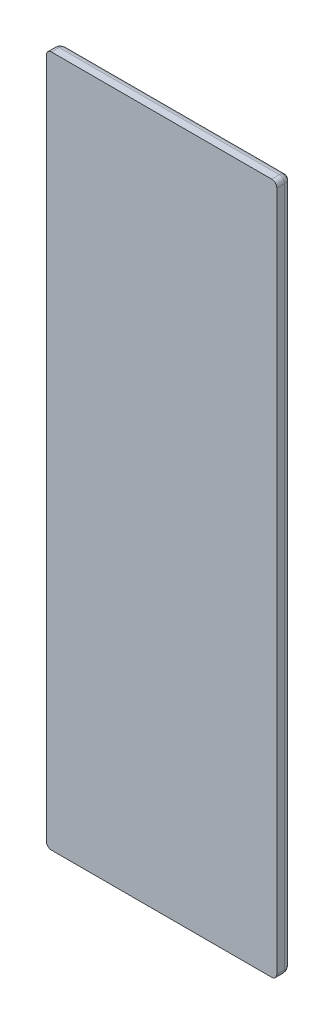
ISO-10303-21;
HEADER;
FILE_DESCRIPTION(('STEP AP214'),'2;1');
FILE_NAME('part.step','',(''),(''),'','','');
FILE_SCHEMA(('AUTOMOTIVE_DESIGN { 1 0 10303 214 1 1 1 1 }'));
ENDSEC;
DATA;
#1=APPLICATION_CONTEXT('core data for automotive mechanical design processes');
#2=APPLICATION_PROTOCOL_DEFINITION('international standard','automotive_design',2000,#1);
#3=PRODUCT_CONTEXT('',#1,'mechanical');
#4=PRODUCT('Part','Part','',(#3));
#5=PRODUCT_RELATED_PRODUCT_CATEGORY('part','',(#4));
#6=PRODUCT_DEFINITION_FORMATION('','',#4);
#7=PRODUCT_DEFINITION_CONTEXT('part definition',#1,'design');
#8=PRODUCT_DEFINITION('design','',#6,#7);
#9=PRODUCT_DEFINITION_SHAPE('','',#8);
#10=(LENGTH_UNIT() NAMED_UNIT(*) SI_UNIT(.MILLI.,.METRE.));
#11=(NAMED_UNIT(*) PLANE_ANGLE_UNIT() SI_UNIT($,.RADIAN.));
#12=(NAMED_UNIT(*) SI_UNIT($,.STERADIAN.) SOLID_ANGLE_UNIT());
#13=UNCERTAINTY_MEASURE_WITH_UNIT(LENGTH_MEASURE(1.E-05),#10,'distance_accuracy_value','');
#14=(GEOMETRIC_REPRESENTATION_CONTEXT(3) GLOBAL_UNCERTAINTY_ASSIGNED_CONTEXT((#13)) GLOBAL_UNIT_ASSIGNED_CONTEXT((#10,
#11,#12)) REPRESENTATION_CONTEXT('',''));
#15=CARTESIAN_POINT('',(0.,0.,0.));
#16=DIRECTION('',(0.,0.,1.));
#17=DIRECTION('',(1.,0.,0.));
#18=AXIS2_PLACEMENT_3D('',#15,#16,#17);
#19=CARTESIAN_POINT('',(21.5,-67.5,1.5));
#20=CARTESIAN_POINT('',(21.6495996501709,-67.5,1.5));
#21=CARTESIAN_POINT('',(21.8738179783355,-67.4486369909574,1.5));
#22=CARTESIAN_POINT('',(22.1286992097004,-67.2883198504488,1.5));
#23=CARTESIAN_POINT('',(22.315061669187,-67.1021470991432,1.5));
#24=CARTESIAN_POINT('',(22.4618744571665,-66.8365612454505,1.5));
#25=CARTESIAN_POINT('',(22.5,-66.6121997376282,1.5));
#26=CARTESIAN_POINT('',(22.5,-66.5,1.5));
#27=CARTESIAN_POINT('',(21.5,-67.5,1.38780026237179));
#28=CARTESIAN_POINT('',(21.6495996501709,-67.5,1.3765841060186));
#29=CARTESIAN_POINT('',(21.8738179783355,-67.4486369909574,1.36367785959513));
#30=CARTESIAN_POINT('',(22.1286992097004,-67.2883198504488,1.35659921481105));
#31=CARTESIAN_POINT('',(22.315061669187,-67.1021470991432,1.3565890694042));
#32=CARTESIAN_POINT('',(22.4618744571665,-66.8365612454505,1.36547389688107));
#33=CARTESIAN_POINT('',(22.5,-66.6121997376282,1.37940644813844));
#34=CARTESIAN_POINT('',(22.5,-66.5,1.38780026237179));
#35=CARTESIAN_POINT('',(21.4936677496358,-67.4810032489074,1.21952596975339));
#36=CARTESIAN_POINT('',(21.6388095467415,-67.4769934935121,1.19181921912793));
#37=CARTESIAN_POINT('',(21.8563501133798,-67.4220055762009,1.15996892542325));
#38=CARTESIAN_POINT('',(22.1051185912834,-67.2621026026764,1.14251249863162));
#39=CARTESIAN_POINT('',(22.2883867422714,-67.0790017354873,1.14248709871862));
#40=CARTESIAN_POINT('',(22.4356025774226,-66.8201958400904,1.16439733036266));
#41=CARTESIAN_POINT('',(22.4779779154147,-66.602519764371,1.19878659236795));
#42=CARTESIAN_POINT('',(22.4810032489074,-66.4936677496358,1.21952596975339));
#43=CARTESIAN_POINT('',(21.462569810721,-67.3877094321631,0.895594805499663));
#44=CARTESIAN_POINT('',(21.5887422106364,-67.3682098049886,0.846186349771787));
#45=CARTESIAN_POINT('',(21.7779308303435,-67.3004944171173,0.789963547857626));
#46=CARTESIAN_POINT('',(21.9999228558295,-67.1445436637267,0.759268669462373));
#47=CARTESIAN_POINT('',(22.1687394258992,-66.9758458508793,0.759230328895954));
#48=CARTESIAN_POINT('',(22.3152388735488,-66.7464583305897,0.797735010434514));
#49=CARTESIAN_POINT('',(22.3731266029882,-66.5572123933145,0.858602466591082));
#50=CARTESIAN_POINT('',(22.3877094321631,-66.462569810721,0.895594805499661));
#51=CARTESIAN_POINT('',(21.3892697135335,-67.1678091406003,0.496992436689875));
#52=CARTESIAN_POINT('',(21.4789201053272,-67.1235219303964,0.445951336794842));
#53=CARTESIAN_POINT('',(21.6134314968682,-67.0389425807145,0.389505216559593));
#54=CARTESIAN_POINT('',(21.7810406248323,-66.8980432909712,0.359033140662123));
#55=CARTESIAN_POINT('',(21.9175825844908,-66.7615406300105,0.359012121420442));
#56=CARTESIAN_POINT('',(22.0546369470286,-66.5910171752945,0.397175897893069));
#57=CARTESIAN_POINT('',(22.1346759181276,-66.4565309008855,0.458744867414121));
#58=CARTESIAN_POINT('',(22.1678091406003,-66.3892697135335,0.496992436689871));
#59=CARTESIAN_POINT('',(21.2243682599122,-66.6731047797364,0.102465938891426));
#60=CARTESIAN_POINT('',(21.2669570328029,-66.6301579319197,0.088465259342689));
#61=CARTESIAN_POINT('',(21.3308775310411,-66.5659359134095,0.073741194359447));
#62=CARTESIAN_POINT('',(21.416229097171,-66.4803146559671,0.065952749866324));
#63=CARTESIAN_POINT('',(21.4910153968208,-66.4055447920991,0.065955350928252));
#64=CARTESIAN_POINT('',(21.5766561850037,-66.3202205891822,0.075680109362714));
#65=CARTESIAN_POINT('',(21.6409626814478,-66.2563274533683,0.091956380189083));
#66=CARTESIAN_POINT('',(21.6731047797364,-66.2243682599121,0.102465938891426));
#67=CARTESIAN_POINT('',(21.0747998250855,-66.2243994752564,0.));
#68=CARTESIAN_POINT('',(21.089047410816,-66.2101518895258,0.));
#69=CARTESIAN_POINT('',(21.1104187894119,-66.18878051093,0.));
#70=CARTESIAN_POINT('',(21.138913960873,-66.1602853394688,0.));
#71=CARTESIAN_POINT('',(21.1638472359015,-66.1353520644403,0.));
#72=CARTESIAN_POINT('',(21.1923424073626,-66.1068568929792,0.));
#73=CARTESIAN_POINT('',(21.2137137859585,-66.0854855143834,0.));
#74=CARTESIAN_POINT('',(21.2243994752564,-66.0747998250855,0.));
#75=CARTESIAN_POINT('',(21.,-66.,0.));
#76=CARTESIAN_POINT('',(21.,-66.,0.));
#77=CARTESIAN_POINT('',(21.,-66.,0.));
#78=CARTESIAN_POINT('',(21.,-66.,0.));
#79=CARTESIAN_POINT('',(21.,-66.,0.));
#80=CARTESIAN_POINT('',(21.,-66.,0.));
#81=CARTESIAN_POINT('',(21.,-66.,0.));
#82=CARTESIAN_POINT('',(21.,-66.,0.));
#83=B_SPLINE_SURFACE_WITH_KNOTS('',3,3,((#19,#20,#21,#22,#23,#24,#25,#26),(#27,#28,#29,#30,#31,
#32,#33,#34),(#35,#36,#37,#38,#39,#40,#41,#42),(#43,#44,#45,#46,#47,#48,#49,#50),(#51,#52,#53,
#54,#55,#56,#57,#58),(#59,#60,#61,#62,#63,#64,#65,#66),(#67,#68,#69,#70,#71,#72,#73,#74),(#75,
#76,#77,#78,#79,#80,#81,#82)),.UNSPECIFIED.,.F.,.F.,.F.,(4,1,1,1,1,4),(4,1,1,1,1,4),(0.,
0.224399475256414,0.336599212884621,0.673198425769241,1.12199737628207,1.5707963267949),(0.,
0.285714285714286,0.428571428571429,0.571428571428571,0.785714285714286,1.),.UNSPECIFIED.);
#84=CARTESIAN_POINT('',(21.,-66.,0.));
#85=CARTESIAN_POINT('',(21.2243994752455,-66.0747998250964,0.));
#86=CARTESIAN_POINT('',(21.6731047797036,-66.2243682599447,0.102465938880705));
#87=CARTESIAN_POINT('',(22.1678091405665,-66.3892697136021,0.496992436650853));
#88=CARTESIAN_POINT('',(22.3877094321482,-66.4625698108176,0.895594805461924));
#89=CARTESIAN_POINT('',(22.4810032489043,-66.4936677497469,1.21952596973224));
#90=CARTESIAN_POINT('',(22.5,-66.5000000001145,1.38780026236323));
#91=CARTESIAN_POINT('',(22.5,-66.5000000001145,1.5));
#92=B_SPLINE_CURVE_WITH_KNOTS('',3,(#84,#85,#86,#87,#88,#89,#90,#91),.UNSPECIFIED.,.F.,.F.,(4,1,
1,1,1,4),(0.,0.448798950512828,0.897597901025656,1.23419711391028,1.34639685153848,
1.5707963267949),.UNSPECIFIED.);
#93=CARTESIAN_POINT('',(22.5,-66.5000000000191,1.5));
#94=VERTEX_POINT('',#93);
#95=CARTESIAN_POINT('',(21.,-66.,0.));
#96=VERTEX_POINT('',#95);
#97=EDGE_CURVE('E113',#94,#96,#92,.F.);
#98=CARTESIAN_POINT('',(22.5,-66.5,1.5));
#99=CARTESIAN_POINT('',(22.5,-66.6121997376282,1.5));
#100=CARTESIAN_POINT('',(22.4618744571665,-66.8365612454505,1.5));
#101=CARTESIAN_POINT('',(22.315061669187,-67.1021470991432,1.5));
#102=CARTESIAN_POINT('',(22.1286992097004,-67.2883198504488,1.5));
#103=CARTESIAN_POINT('',(21.8738179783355,-67.4486369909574,1.5));
#104=CARTESIAN_POINT('',(21.6495996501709,-67.5,1.5));
#105=CARTESIAN_POINT('',(21.5,-67.5,1.5));
#106=B_SPLINE_CURVE_WITH_KNOTS('',3,(#98,#99,#100,#101,#102,#103,#104,#105),.UNSPECIFIED.,.F.,
.F.,(4,1,1,1,1,4),(0.,0.214285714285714,0.428571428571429,0.571428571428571,0.714285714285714,
1.),.UNSPECIFIED.);
#107=CARTESIAN_POINT('',(21.5,-67.5,1.5));
#108=VERTEX_POINT('',#107);
#109=EDGE_CURVE('E96',#94,#108,#106,.T.);
#110=CARTESIAN_POINT('',(21.5,-67.5,1.5));
#111=CARTESIAN_POINT('',(21.5000000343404,-67.5000001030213,1.48036480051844));
#112=CARTESIAN_POINT('',(21.4998707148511,-67.4996121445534,1.46072976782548));
#113=CARTESIAN_POINT('',(21.4993548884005,-67.4980646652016,1.4214906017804));
#114=CARTESIAN_POINT('',(21.498968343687,-67.496905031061,1.40188647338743));
#115=CARTESIAN_POINT('',(21.4979394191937,-67.4938182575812,1.36273904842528));
#116=CARTESIAN_POINT('',(21.497296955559,-67.4918908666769,1.34319577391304));
#117=CARTESIAN_POINT('',(21.4957575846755,-67.4872727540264,1.30419986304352));
#118=CARTESIAN_POINT('',(21.4948605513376,-67.4845816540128,1.28474727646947));
#119=CARTESIAN_POINT('',(21.4928134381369,-67.4784403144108,1.24596255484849));
#120=CARTESIAN_POINT('',(21.4916631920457,-67.474989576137,1.22663050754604));
#121=CARTESIAN_POINT('',(21.4891109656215,-67.4673328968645,1.18811671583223));
#122=CARTESIAN_POINT('',(21.4877087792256,-67.4631263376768,1.16893510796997));
#123=CARTESIAN_POINT('',(21.4846543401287,-67.4539630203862,1.13075190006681));
#124=CARTESIAN_POINT('',(21.4830018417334,-67.4490055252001,1.11175049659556));
#125=CARTESIAN_POINT('',(21.4794494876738,-67.4383484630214,1.07395661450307));
#126=CARTESIAN_POINT('',(21.4775493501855,-67.4326480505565,1.05516440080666));
#127=CARTESIAN_POINT('',(21.4735040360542,-67.4205121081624,1.01781818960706));
#128=CARTESIAN_POINT('',(21.4713585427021,-67.4140756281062,0.999264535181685));
#129=CARTESIAN_POINT('',(21.4668259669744,-67.4004779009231,0.962423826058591));
#130=CARTESIAN_POINT('',(21.4644385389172,-67.3933156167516,0.944137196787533));
#131=CARTESIAN_POINT('',(21.4594269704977,-67.3782809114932,0.907857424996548));
#132=CARTESIAN_POINT('',(21.4568024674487,-67.3704074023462,0.889864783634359));
#133=CARTESIAN_POINT('',(21.4513213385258,-67.3539640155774,0.854200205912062));
#134=CARTESIAN_POINT('',(21.4484643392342,-67.3453930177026,0.836528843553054));
#135=CARTESIAN_POINT('',(21.4425228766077,-67.327568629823,0.801533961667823));
#136=CARTESIAN_POINT('',(21.4394380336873,-67.318314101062,0.784211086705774));
#137=CARTESIAN_POINT('',(21.4330455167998,-67.2991365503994,0.749940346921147));
#138=CARTESIAN_POINT('',(21.4297374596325,-67.2892123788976,0.732993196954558));
#139=CARTESIAN_POINT('',(21.4229031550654,-67.2687094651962,0.699501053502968));
#140=CARTESIAN_POINT('',(21.4193765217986,-67.2581295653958,0.682956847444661));
#141=CARTESIAN_POINT('',(21.4121096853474,-67.2363290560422,0.650297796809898));
#142=CARTESIAN_POINT('',(21.4083690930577,-67.225107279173,0.634183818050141));
#143=CARTESIAN_POINT('',(21.4006790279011,-67.2020370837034,0.602412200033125));
#144=CARTESIAN_POINT('',(21.3967291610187,-67.1901874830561,0.58675551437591));
#145=CARTESIAN_POINT('',(21.388624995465,-67.165874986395,0.555926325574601));
#146=CARTESIAN_POINT('',(21.3844702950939,-67.1534108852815,0.5407548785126));
#147=CARTESIAN_POINT('',(21.3759640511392,-67.1278921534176,0.510916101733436));
#148=CARTESIAN_POINT('',(21.3716121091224,-67.1148363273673,0.496249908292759));
#149=CARTESIAN_POINT('',(21.3627193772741,-67.0881581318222,0.467440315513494));
#150=CARTESIAN_POINT('',(21.358178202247,-67.0745346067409,0.453298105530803));
#151=CARTESIAN_POINT('',(21.3489148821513,-67.0467446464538,0.425555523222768));
#152=CARTESIAN_POINT('',(21.3441923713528,-67.0325771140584,0.411956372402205));
#153=CARTESIAN_POINT('',(21.33457428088,-67.0037228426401,0.385318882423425));
#154=CARTESIAN_POINT('',(21.3296783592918,-66.9890350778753,0.372281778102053));
#155=CARTESIAN_POINT('',(21.3197213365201,-66.9591640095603,0.346787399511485));
#156=CARTESIAN_POINT('',(21.3146599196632,-66.9439797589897,0.334331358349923));
#157=CARTESIAN_POINT('',(21.3043797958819,-66.9131393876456,0.310018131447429));
#158=CARTESIAN_POINT('',(21.2991608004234,-66.8974824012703,0.298162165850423));
#159=CARTESIAN_POINT('',(21.2885734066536,-66.8657202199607,0.275068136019));
#160=CARTESIAN_POINT('',(21.2832047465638,-66.8496142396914,0.263831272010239));
#161=CARTESIAN_POINT('',(21.2723259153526,-66.8169777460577,0.241994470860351));
#162=CARTESIAN_POINT('',(21.2668155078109,-66.8004465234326,0.231395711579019));
#163=CARTESIAN_POINT('',(21.2556610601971,-66.7669831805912,0.210854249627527));
#164=CARTESIAN_POINT('',(21.2500168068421,-66.7500504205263,0.200912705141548));
#165=CARTESIAN_POINT('',(21.2386026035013,-66.7158078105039,0.181704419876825));
#166=CARTESIAN_POINT('',(21.2328324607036,-66.6984973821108,0.172438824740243));
#167=CARTESIAN_POINT('',(21.2211742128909,-66.6635226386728,0.154602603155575));
#168=CARTESIAN_POINT('',(21.2152859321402,-66.6458577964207,0.14603312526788));
#169=CARTESIAN_POINT('',(21.2034002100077,-66.610200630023,0.129603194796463));
#170=CARTESIAN_POINT('',(21.1974026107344,-66.5922078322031,0.12174388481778));
#171=CARTESIAN_POINT('',(21.1853083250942,-66.5559249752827,0.106739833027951));
#172=CARTESIAN_POINT('',(21.17921150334,-66.5376345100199,0.0995961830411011));
#173=CARTESIAN_POINT('',(21.166928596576,-66.5007857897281,0.0860307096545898));
#174=CARTESIAN_POINT('',(21.16074239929,-66.4822271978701,0.0796099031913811));
#175=CARTESIAN_POINT('',(21.148290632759,-66.4448718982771,0.0674969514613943));
#176=CARTESIAN_POINT('',(21.1420249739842,-66.4260749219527,0.0618057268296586));
#177=CARTESIAN_POINT('',(21.1294241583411,-66.3882724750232,0.0511589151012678));
#178=CARTESIAN_POINT('',(21.1230889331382,-66.3692667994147,0.0462041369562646));
#179=CARTESIAN_POINT('',(21.1103588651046,-66.3310765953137,0.0370371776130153));
#180=CARTESIAN_POINT('',(21.1039639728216,-66.3118919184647,0.0328256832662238));
#181=CARTESIAN_POINT('',(21.0911244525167,-66.2733733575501,0.025152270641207));
#182=CARTESIAN_POINT('',(21.0846797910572,-66.2540393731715,0.0216909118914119));
#183=CARTESIAN_POINT('',(21.0717506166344,-66.2152518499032,0.0155247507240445));
#184=CARTESIAN_POINT('',(21.0652660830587,-66.1957982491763,0.0128203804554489));
#185=CARTESIAN_POINT('',(21.0522670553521,-66.1568011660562,0.00817518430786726));
#186=CARTESIAN_POINT('',(21.0457525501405,-66.1372576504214,0.00623466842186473));
#187=CARTESIAN_POINT('',(21.0327034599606,-66.0981103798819,0.0031241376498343));
#188=CARTESIAN_POINT('',(21.026168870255,-66.0785066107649,0.00195432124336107));
#189=CARTESIAN_POINT('',(21.0130895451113,-66.0392686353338,0.000392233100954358));
#190=CARTESIAN_POINT('',(21.0065448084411,-66.0196344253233,6.46496743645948E-08));
#191=CARTESIAN_POINT('',(21.,-66.,0.));
#192=B_SPLINE_CURVE_WITH_KNOTS('',3,(#110,#111,#112,#113,#114,#115,#116,#117,#118,#119,#120,
#121,#122,#123,#124,#125,#126,#127,#128,#129,#130,#131,#132,#133,#134,#135,#136,#137,#138,#139,
#140,#141,#142,#143,#144,#145,#146,#147,#148,#149,#150,#151,#152,#153,#154,#155,#156,#157,#158,
#159,#160,#161,#162,#163,#164,#165,#166,#167,#168,#169,#170,#171,#172,#173,#174,#175,#176,#177,
#178,#179,#180,#181,#182,#183,#184,#185,#186,#187,#188,#189,#190,#191),.UNSPECIFIED.,.F.,.F.,(4,
2,2,2,2,2,2,2,2,2,2,2,2,2,2,2,2,2,2,2,2,2,2,2,2,2,2,2,2,2,2,2,2,2,2,2,2,2,2,2,4),(0.,
0.0589011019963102,0.117810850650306,0.176739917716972,0.235698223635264,0.29469535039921,
0.353740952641,0.412844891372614,0.4720166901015,0.531265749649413,0.590600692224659,
0.650027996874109,0.709552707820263,0.769178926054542,0.828910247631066,0.888750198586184,
0.948702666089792,1.00877232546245,1.06896487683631,1.12928496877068,1.18973449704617,
1.25031310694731,1.31101865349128,1.37184765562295,1.43279574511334,1.49385811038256,
1.55502993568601,1.61630683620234,1.6776852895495,1.73916304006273,1.8007380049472,
1.86240552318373,1.92415874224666,1.98598913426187,2.04788694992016,2.10984166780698,
2.17184244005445,2.23387853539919,2.29593978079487,2.35801700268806,2.42010246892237),.UNSPECIFIED.);
#193=EDGE_CURVE('E117',#96,#108,#192,.F.);
#194=ORIENTED_EDGE('',*,*,#97,.F.);
#195=ORIENTED_EDGE('',*,*,#109,.T.);
#196=ORIENTED_EDGE('',*,*,#193,.F.);
#197=EDGE_LOOP('',(#194,#195,#196));
#198=FACE_BOUND('',#197,.T.);
#199=ADVANCED_FACE('F16',(#198),#83,.T.);
#200=CARTESIAN_POINT('',(22.5,66.5,1.5));
#201=CARTESIAN_POINT('',(22.5,66.649599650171,1.5));
#202=CARTESIAN_POINT('',(22.4486369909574,66.8738179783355,1.5));
#203=CARTESIAN_POINT('',(22.2883198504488,67.1286992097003,1.5));
#204=CARTESIAN_POINT('',(22.1021470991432,67.3150616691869,1.5));
#205=CARTESIAN_POINT('',(21.8365612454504,67.4618744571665,1.5));
#206=CARTESIAN_POINT('',(21.6121997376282,67.5,1.5));
#207=CARTESIAN_POINT('',(21.5,67.5,1.5));
#208=CARTESIAN_POINT('',(22.5,66.5,1.38780026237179));
#209=CARTESIAN_POINT('',(22.5,66.649599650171,1.3765841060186));
#210=CARTESIAN_POINT('',(22.4486369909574,66.8738179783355,1.36367785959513));
#211=CARTESIAN_POINT('',(22.2883198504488,67.1286992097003,1.35659921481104));
#212=CARTESIAN_POINT('',(22.1021470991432,67.3150616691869,1.3565890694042));
#213=CARTESIAN_POINT('',(21.8365612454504,67.4618744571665,1.36547389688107));
#214=CARTESIAN_POINT('',(21.6121997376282,67.5,1.37940644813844));
#215=CARTESIAN_POINT('',(21.5,67.5,1.38780026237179));
#216=CARTESIAN_POINT('',(22.4745870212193,66.4915290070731,1.16354424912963));
#217=CARTESIAN_POINT('',(22.4694358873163,66.6352791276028,1.1300752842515));
#218=CARTESIAN_POINT('',(22.4134457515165,66.8507424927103,1.09154209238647));
#219=CARTESIAN_POINT('',(22.2537321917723,67.0975953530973,1.07040899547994));
#220=CARTESIAN_POINT('',(22.0716177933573,67.2798730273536,1.07037784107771));
#221=CARTESIAN_POINT('',(21.8149302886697,67.4271429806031,1.09690476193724));
#222=CARTESIAN_POINT('',(21.5993392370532,67.4707116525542,1.13849398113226));
#223=CARTESIAN_POINT('',(21.4915290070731,67.4745870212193,1.16354424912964));
#224=CARTESIAN_POINT('',(22.3257585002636,66.4419195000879,0.736975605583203));
#225=CARTESIAN_POINT('',(22.2962162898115,66.5557427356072,0.68063723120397));
#226=CARTESIAN_POINT('',(22.2204085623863,66.7264648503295,0.617015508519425));
#227=CARTESIAN_POINT('',(22.0673073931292,66.9308947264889,0.582383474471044));
#228=CARTESIAN_POINT('',(21.9081734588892,67.0901157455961,0.582345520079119));
#229=CARTESIAN_POINT('',(21.6980442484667,67.2358556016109,0.625770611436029));
#230=CARTESIAN_POINT('',(21.5273088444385,67.3036739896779,0.694786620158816));
#231=CARTESIAN_POINT('',(21.4419195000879,67.3257585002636,0.736975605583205));
#232=CARTESIAN_POINT('',(22.0388385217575,66.3462795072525,0.377495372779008));
#233=CARTESIAN_POINT('',(21.9924880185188,66.4223655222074,0.337547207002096));
#234=CARTESIAN_POINT('',(21.9109760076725,66.536523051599,0.29381832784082));
#235=CARTESIAN_POINT('',(21.7838412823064,66.6810914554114,0.270305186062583));
#236=CARTESIAN_POINT('',(21.663966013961,66.8009930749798,0.270293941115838));
#237=CARTESIAN_POINT('',(21.5174986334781,66.9256165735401,0.299724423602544));
#238=CARTESIAN_POINT('',(21.4033613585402,67.004138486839,0.347551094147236));
#239=CARTESIAN_POINT('',(21.3462795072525,67.0388385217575,0.377495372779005));
#240=CARTESIAN_POINT('',(21.5605778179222,66.1868592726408,0.077186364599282));
#241=CARTESIAN_POINT('',(21.5254468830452,66.2226866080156,0.066456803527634));
#242=CARTESIAN_POINT('',(21.4725851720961,66.2764620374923,0.055005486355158));
#243=CARTESIAN_POINT('',(21.4014686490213,66.3479796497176,0.04891129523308));
#244=CARTESIAN_POINT('',(21.3390620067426,66.4104029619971,0.048911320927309));
#245=CARTESIAN_POINT('',(21.2674966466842,66.4814436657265,0.056527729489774));
#246=CARTESIAN_POINT('',(21.2137463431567,66.534292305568,0.069135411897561));
#247=CARTESIAN_POINT('',(21.1868592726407,66.5605778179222,0.077186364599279));
#248=CARTESIAN_POINT('',(21.2243994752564,66.0747998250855,0.));
#249=CARTESIAN_POINT('',(21.2101518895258,66.089047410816,0.));
#250=CARTESIAN_POINT('',(21.18878051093,66.1104187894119,0.));
#251=CARTESIAN_POINT('',(21.1602853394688,66.138913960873,0.));
#252=CARTESIAN_POINT('',(21.1353520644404,66.1638472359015,0.));
#253=CARTESIAN_POINT('',(21.1068568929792,66.1923424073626,0.));
#254=CARTESIAN_POINT('',(21.0854855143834,66.2137137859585,0.));
#255=CARTESIAN_POINT('',(21.0747998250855,66.2243994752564,0.));
#256=CARTESIAN_POINT('',(21.,66.,0.));
#257=CARTESIAN_POINT('',(21.,66.,0.));
#258=CARTESIAN_POINT('',(21.,66.,0.));
#259=CARTESIAN_POINT('',(21.,66.,0.));
#260=CARTESIAN_POINT('',(21.,66.,0.));
#261=CARTESIAN_POINT('',(21.,66.,0.));
#262=CARTESIAN_POINT('',(21.,66.,0.));
#263=CARTESIAN_POINT('',(21.,66.,0.));
#264=B_SPLINE_SURFACE_WITH_KNOTS('',3,3,((#200,#201,#202,#203,#204,#205,#206,#207),(#208,#209,
#210,#211,#212,#213,#214,#215),(#216,#217,#218,#219,#220,#221,#222,#223),(#224,#225,#226,#227,
#228,#229,#230,#231),(#232,#233,#234,#235,#236,#237,#238,#239),(#240,#241,#242,#243,#244,#245,
#246,#247),(#248,#249,#250,#251,#252,#253,#254,#255),(#256,#257,#258,#259,#260,#261,#262,#263)),
.UNSPECIFIED.,.F.,.F.,.F.,(4,1,1,1,1,4),(4,1,1,1,1,4),(0.,0.224399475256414,0.448798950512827,
0.897597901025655,1.12199737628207,1.5707963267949),(0.,0.285714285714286,0.428571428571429,
0.571428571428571,0.785714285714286,1.),.UNSPECIFIED.);
#265=CARTESIAN_POINT('',(21.,66.,0.));
#266=CARTESIAN_POINT('',(21.0747998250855,66.2243994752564,0.));
#267=CARTESIAN_POINT('',(21.1868592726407,66.5605778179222,0.0771863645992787));
#268=CARTESIAN_POINT('',(21.3462795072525,67.0388385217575,0.377495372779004));
#269=CARTESIAN_POINT('',(21.4419195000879,67.3257585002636,0.736975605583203));
#270=CARTESIAN_POINT('',(21.4915290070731,67.4745870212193,1.16354424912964));
#271=CARTESIAN_POINT('',(21.5,67.5,1.38780026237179));
#272=CARTESIAN_POINT('',(21.5,67.5,1.5));
#273=B_SPLINE_CURVE_WITH_KNOTS('',3,(#265,#266,#267,#268,#269,#270,#271,#272),.UNSPECIFIED.,.F.,
.F.,(4,1,1,1,1,4),(0.,0.448798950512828,0.673198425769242,1.12199737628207,1.34639685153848,
1.5707963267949),.UNSPECIFIED.);
#274=CARTESIAN_POINT('',(21.5,67.5,1.5));
#275=VERTEX_POINT('',#274);
#276=CARTESIAN_POINT('',(21.,66.,0.));
#277=VERTEX_POINT('',#276);
#278=EDGE_CURVE('E232',#275,#277,#273,.F.);
#279=CARTESIAN_POINT('',(21.5,67.5,1.5));
#280=CARTESIAN_POINT('',(21.6121997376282,67.5,1.5));
#281=CARTESIAN_POINT('',(21.8365612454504,67.4618744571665,1.5));
#282=CARTESIAN_POINT('',(22.1021470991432,67.3150616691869,1.5));
#283=CARTESIAN_POINT('',(22.2883198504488,67.1286992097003,1.5));
#284=CARTESIAN_POINT('',(22.4486369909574,66.8738179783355,1.5));
#285=CARTESIAN_POINT('',(22.5,66.649599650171,1.5));
#286=CARTESIAN_POINT('',(22.5,66.5,1.5));
#287=B_SPLINE_CURVE_WITH_KNOTS('',3,(#279,#280,#281,#282,#283,#284,#285,#286),.UNSPECIFIED.,.F.,
.F.,(4,1,1,1,1,4),(0.,0.214285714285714,0.428571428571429,0.571428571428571,0.714285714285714,
1.),.UNSPECIFIED.);
#288=CARTESIAN_POINT('',(22.5,66.5,1.5));
#289=VERTEX_POINT('',#288);
#290=EDGE_CURVE('E109',#275,#289,#287,.T.);
#291=CARTESIAN_POINT('',(22.5,66.5,1.5));
#292=CARTESIAN_POINT('',(22.5,66.5,1.38780026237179));
#293=CARTESIAN_POINT('',(22.4745870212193,66.4915290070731,1.16354424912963));
#294=CARTESIAN_POINT('',(22.3257585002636,66.4419195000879,0.7369756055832));
#295=CARTESIAN_POINT('',(22.0388385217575,66.3462795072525,0.377495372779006));
#296=CARTESIAN_POINT('',(21.5605778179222,66.1868592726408,0.0771863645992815));
#297=CARTESIAN_POINT('',(21.2243994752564,66.0747998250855,0.));
#298=CARTESIAN_POINT('',(21.,66.,0.));
#299=B_SPLINE_CURVE_WITH_KNOTS('',3,(#291,#292,#293,#294,#295,#296,#297,#298),.UNSPECIFIED.,.F.,
.F.,(4,1,1,1,1,4),(0.,0.224399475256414,0.448798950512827,0.897597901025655,1.12199737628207,
1.5707963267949),.UNSPECIFIED.);
#300=EDGE_CURVE('E124',#277,#289,#299,.F.);
#301=ORIENTED_EDGE('',*,*,#278,.F.);
#302=ORIENTED_EDGE('',*,*,#290,.T.);
#303=ORIENTED_EDGE('',*,*,#300,.F.);
#304=EDGE_LOOP('',(#301,#302,#303));
#305=FACE_BOUND('',#304,.T.);
#306=ADVANCED_FACE('F332',(#305),#264,.T.);
#307=CARTESIAN_POINT('',(-21.5,67.5,1.5));
#308=CARTESIAN_POINT('',(-21.649599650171,67.5,1.5));
#309=CARTESIAN_POINT('',(-21.8738179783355,67.4486369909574,1.5));
#310=CARTESIAN_POINT('',(-22.1286992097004,67.2883198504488,1.5));
#311=CARTESIAN_POINT('',(-22.315061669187,67.1021470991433,1.5));
#312=CARTESIAN_POINT('',(-22.4618744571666,66.8365612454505,1.5));
#313=CARTESIAN_POINT('',(-22.5,66.6121997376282,1.5));
#314=CARTESIAN_POINT('',(-22.5,66.5,1.5));
#315=CARTESIAN_POINT('',(-21.5,67.5,1.38780026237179));
#316=CARTESIAN_POINT('',(-21.649599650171,67.5,1.3765841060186));
#317=CARTESIAN_POINT('',(-21.8738179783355,67.4486369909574,1.36367785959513));
#318=CARTESIAN_POINT('',(-22.1286992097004,67.2883198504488,1.35659921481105));
#319=CARTESIAN_POINT('',(-22.315061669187,67.1021470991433,1.3565890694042));
#320=CARTESIAN_POINT('',(-22.4618744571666,66.8365612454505,1.36547389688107));
#321=CARTESIAN_POINT('',(-22.5,66.6121997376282,1.37940644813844));
#322=CARTESIAN_POINT('',(-22.5,66.5,1.3878002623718));
#323=CARTESIAN_POINT('',(-21.4936677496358,67.4810032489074,1.2195259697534));
#324=CARTESIAN_POINT('',(-21.6388095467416,67.4769934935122,1.19181921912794));
#325=CARTESIAN_POINT('',(-21.8563501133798,67.4220055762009,1.15996892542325));
#326=CARTESIAN_POINT('',(-22.1051185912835,67.2621026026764,1.14251249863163));
#327=CARTESIAN_POINT('',(-22.2883867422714,67.0790017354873,1.14248709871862));
#328=CARTESIAN_POINT('',(-22.4356025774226,66.8201958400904,1.16439733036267));
#329=CARTESIAN_POINT('',(-22.4779779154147,66.602519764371,1.19878659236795));
#330=CARTESIAN_POINT('',(-22.4810032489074,66.4936677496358,1.21952596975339));
#331=CARTESIAN_POINT('',(-21.462569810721,67.3877094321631,0.895594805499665));
#332=CARTESIAN_POINT('',(-21.5887422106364,67.3682098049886,0.846186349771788));
#333=CARTESIAN_POINT('',(-21.7779308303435,67.3004944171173,0.78996354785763));
#334=CARTESIAN_POINT('',(-21.9999228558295,67.1445436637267,0.759268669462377));
#335=CARTESIAN_POINT('',(-22.1687394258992,66.9758458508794,0.759230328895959));
#336=CARTESIAN_POINT('',(-22.3152388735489,66.7464583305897,0.797735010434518));
#337=CARTESIAN_POINT('',(-22.3731266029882,66.5572123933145,0.858602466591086));
#338=CARTESIAN_POINT('',(-22.3877094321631,66.462569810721,0.895594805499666));
#339=CARTESIAN_POINT('',(-21.3892697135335,67.1678091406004,0.496992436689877));
#340=CARTESIAN_POINT('',(-21.4789201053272,67.1235219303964,0.445951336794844));
#341=CARTESIAN_POINT('',(-21.6134314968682,67.0389425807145,0.389505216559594));
#342=CARTESIAN_POINT('',(-21.7810406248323,66.8980432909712,0.359033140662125));
#343=CARTESIAN_POINT('',(-21.9175825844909,66.7615406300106,0.359012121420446));
#344=CARTESIAN_POINT('',(-22.0546369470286,66.5910171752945,0.397175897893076));
#345=CARTESIAN_POINT('',(-22.1346759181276,66.4565309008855,0.458744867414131));
#346=CARTESIAN_POINT('',(-22.1678091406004,66.3892697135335,0.496992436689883));
#347=CARTESIAN_POINT('',(-21.2243682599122,66.6731047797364,0.102465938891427));
#348=CARTESIAN_POINT('',(-21.2669570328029,66.6301579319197,0.088465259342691));
#349=CARTESIAN_POINT('',(-21.3308775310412,66.5659359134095,0.073741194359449));
#350=CARTESIAN_POINT('',(-21.416229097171,66.4803146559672,0.065952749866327));
#351=CARTESIAN_POINT('',(-21.4910153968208,66.4055447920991,0.065955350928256));
#352=CARTESIAN_POINT('',(-21.5766561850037,66.3202205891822,0.075680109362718));
#353=CARTESIAN_POINT('',(-21.6409626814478,66.2563274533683,0.091956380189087));
#354=CARTESIAN_POINT('',(-21.6731047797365,66.2243682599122,0.102465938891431));
#355=CARTESIAN_POINT('',(-21.0747998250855,66.2243994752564,0.));
#356=CARTESIAN_POINT('',(-21.0890474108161,66.2101518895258,0.));
#357=CARTESIAN_POINT('',(-21.1104187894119,66.18878051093,0.));
#358=CARTESIAN_POINT('',(-21.138913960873,66.1602853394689,0.));
#359=CARTESIAN_POINT('',(-21.1638472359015,66.1353520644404,0.));
#360=CARTESIAN_POINT('',(-21.1923424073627,66.1068568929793,0.));
#361=CARTESIAN_POINT('',(-21.2137137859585,66.0854855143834,0.));
#362=CARTESIAN_POINT('',(-21.2243994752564,66.0747998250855,0.));
#363=CARTESIAN_POINT('',(-21.,66.,0.));
#364=CARTESIAN_POINT('',(-21.,66.,0.));
#365=CARTESIAN_POINT('',(-21.,66.,0.));
#366=CARTESIAN_POINT('',(-21.,66.,0.));
#367=CARTESIAN_POINT('',(-21.,66.,0.));
#368=CARTESIAN_POINT('',(-21.,66.,0.));
#369=CARTESIAN_POINT('',(-21.,66.,0.));
#370=CARTESIAN_POINT('',(-21.,66.,0.));
#371=B_SPLINE_SURFACE_WITH_KNOTS('',3,3,((#307,#308,#309,#310,#311,#312,#313,#314),(#315,#316,
#317,#318,#319,#320,#321,#322),(#323,#324,#325,#326,#327,#328,#329,#330),(#331,#332,#333,#334,
#335,#336,#337,#338),(#339,#340,#341,#342,#343,#344,#345,#346),(#347,#348,#349,#350,#351,#352,
#353,#354),(#355,#356,#357,#358,#359,#360,#361,#362),(#363,#364,#365,#366,#367,#368,#369,#370)),
.UNSPECIFIED.,.F.,.F.,.F.,(4,1,1,1,1,4),(4,1,1,1,1,4),(0.,0.224399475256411,0.336599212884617,
0.673198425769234,1.12199737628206,1.57079632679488),(0.,0.285714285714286,0.428571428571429,
0.571428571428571,0.785714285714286,1.),.UNSPECIFIED.);
#372=CARTESIAN_POINT('',(-21.,66.,0.));
#373=CARTESIAN_POINT('',(-21.2243994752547,66.0747998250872,0.));
#374=CARTESIAN_POINT('',(-21.6731047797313,66.2243682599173,0.102465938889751));
#375=CARTESIAN_POINT('',(-22.1678091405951,66.3892697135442,0.496992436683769));
#376=CARTESIAN_POINT('',(-22.3877094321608,66.4625698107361,0.895594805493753));
#377=CARTESIAN_POINT('',(-22.4810032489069,66.4936677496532,1.21952596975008));
#378=CARTESIAN_POINT('',(-22.5,66.5000000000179,1.38780026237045));
#379=CARTESIAN_POINT('',(-22.5,66.5000000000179,1.5));
#380=B_SPLINE_CURVE_WITH_KNOTS('',3,(#372,#373,#374,#375,#376,#377,#378,#379),.UNSPECIFIED.,.F.,
.F.,(4,1,1,1,1,4),(0.,0.448798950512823,0.897597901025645,1.23419711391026,1.34639685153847,
1.57079632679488),.UNSPECIFIED.);
#381=CARTESIAN_POINT('',(-22.5,66.500000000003,1.5));
#382=VERTEX_POINT('',#381);
#383=CARTESIAN_POINT('',(-21.,66.,0.));
#384=VERTEX_POINT('',#383);
#385=EDGE_CURVE('E171',#382,#384,#380,.F.);
#386=CARTESIAN_POINT('',(-22.5,66.5,1.5));
#387=CARTESIAN_POINT('',(-22.5000000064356,66.5130898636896,1.5));
#388=CARTESIAN_POINT('',(-22.49974053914,66.5261796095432,1.5));
#389=CARTESIAN_POINT('',(-22.4987060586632,66.5523386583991,1.5));
#390=CARTESIAN_POINT('',(-22.4979310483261,66.5654079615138,1.5));
#391=CARTESIAN_POINT('',(-22.49586887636,66.5915061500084,1.5));
#392=CARTESIAN_POINT('',(-22.4945817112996,66.6045350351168,1.5));
#393=CARTESIAN_POINT('',(-22.4914986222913,66.6305324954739,1.5));
#394=CARTESIAN_POINT('',(-22.4897026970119,66.6435010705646,1.5));
#395=CARTESIAN_POINT('',(-22.4856054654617,66.6693579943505,1.5));
#396=CARTESIAN_POINT('',(-22.4833041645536,66.6822463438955,1.5));
#397=CARTESIAN_POINT('',(-22.4781995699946,66.7079229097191,1.5));
#398=CARTESIAN_POINT('',(-22.4753962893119,66.7207111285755,1.5));
#399=CARTESIAN_POINT('',(-22.4692910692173,66.7461675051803,1.5));
#400=CARTESIAN_POINT('',(-22.4659891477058,66.7588356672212,1.5));
#401=CARTESIAN_POINT('',(-22.4588901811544,66.7840320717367,1.5));
#402=CARTESIAN_POINT('',(-22.4550931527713,66.7965603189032,1.5));
#403=CARTESIAN_POINT('',(-22.4470067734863,66.8214567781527,1.5));
#404=CARTESIAN_POINT('',(-22.4427174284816,66.8338249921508,1.5));
#405=CARTESIAN_POINT('',(-22.433652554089,66.8583822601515,1.5));
#406=CARTESIAN_POINT('',(-22.4288770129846,66.8705713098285,1.5));
#407=CARTESIAN_POINT('',(-22.4188503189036,66.894752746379,1.5));
#408=CARTESIAN_POINT('',(-22.413599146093,66.9067451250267,1.5));
#409=CARTESIAN_POINT('',(-22.4026308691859,66.9305154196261,1.5));
#410=CARTESIAN_POINT('',(-22.3969137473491,66.9422933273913,1.5));
#411=CARTESIAN_POINT('',(-22.3850234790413,66.9656169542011,1.5));
#412=CARTESIAN_POINT('',(-22.3788503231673,66.9771626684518,1.5));
#413=CARTESIAN_POINT('',(-22.3660578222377,67.000004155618,1.5));
#414=CARTESIAN_POINT('',(-22.3594384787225,67.0112999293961,1.5));
#415=CARTESIAN_POINT('',(-22.3457634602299,67.0336237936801,1.5));
#416=CARTESIAN_POINT('',(-22.3387077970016,67.0446518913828,1.5));
#417=CARTESIAN_POINT('',(-22.3241699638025,67.06642263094,1.5));
#418=CARTESIAN_POINT('',(-22.3166878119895,67.077165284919,1.5));
#419=CARTESIAN_POINT('',(-22.3013069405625,67.0983474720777,1.5));
#420=CARTESIAN_POINT('',(-22.2934082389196,67.1087870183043,1.5));
#421=CARTESIAN_POINT('',(-22.277203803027,67.1293449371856,1.5));
#422=CARTESIAN_POINT('',(-22.2688980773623,67.139463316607,1.5));
#423=CARTESIAN_POINT('',(-22.2518939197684,67.1593647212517,1.5));
#424=CARTESIAN_POINT('',(-22.2431954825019,67.169147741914,1.5));
#425=CARTESIAN_POINT('',(-22.2254208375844,67.1883649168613,1.5));
#426=CARTESIAN_POINT('',(-22.2163446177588,67.1977990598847,1.5));
#427=CARTESIAN_POINT('',(-22.1978291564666,67.2163047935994,1.5));
#428=CARTESIAN_POINT('',(-22.1883899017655,67.2253763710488,1.5));
#429=CARTESIAN_POINT('',(-22.1691631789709,67.2431433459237,1.5));
#430=CARTESIAN_POINT('',(-22.1593756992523,67.2518387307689,1.5));
#431=CARTESIAN_POINT('',(-22.13946725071,67.2688396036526,1.5));
#432=CARTESIAN_POINT('',(-22.1293462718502,67.2771450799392,1.5));
#433=CARTESIAN_POINT('',(-22.1087858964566,67.2933526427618,1.5));
#434=CARTESIAN_POINT('',(-22.0983464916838,67.3012547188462,1.5));
#435=CARTESIAN_POINT('',(-22.0771661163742,67.3166438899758,1.5));
#436=CARTESIAN_POINT('',(-22.0664251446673,67.3241309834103,1.5));
#437=CARTESIAN_POINT('',(-22.0446583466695,67.3386784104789,1.5));
#438=CARTESIAN_POINT('',(-22.0336325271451,67.3457387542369,1.5));
#439=CARTESIAN_POINT('',(-22.0113127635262,67.3594208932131,1.5));
#440=CARTESIAN_POINT('',(-22.0000188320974,67.3660427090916,1.5));
#441=CARTESIAN_POINT('',(-21.9771796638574,67.3788361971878,1.5));
#442=CARTESIAN_POINT('',(-21.9656344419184,67.3850078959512,1.5));
#443=CARTESIAN_POINT('',(-21.9423091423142,67.3968888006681,1.5));
#444=CARTESIAN_POINT('',(-21.9305290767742,67.4025980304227,1.5));
#445=CARTESIAN_POINT('',(-21.9067521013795,67.4135450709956,1.5));
#446=CARTESIAN_POINT('',(-21.8947551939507,67.4187828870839,1.5));
#447=CARTESIAN_POINT('',(-21.8705644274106,67.4287829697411,1.5));
#448=CARTESIAN_POINT('',(-21.8583705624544,67.433545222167,1.5));
#449=CARTESIAN_POINT('',(-21.8338053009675,67.4425891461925,1.5));
#450=CARTESIAN_POINT('',(-21.8214338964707,67.4468707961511,1.5));
#451=CARTESIAN_POINT('',(-21.7965330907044,67.454948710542,1.5));
#452=CARTESIAN_POINT('',(-21.7840036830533,67.4587449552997,1.5));
#453=CARTESIAN_POINT('',(-21.7588063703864,67.4658471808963,1.5));
#454=CARTESIAN_POINT('',(-21.7461384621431,67.4691531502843,1.5));
#455=CARTESIAN_POINT('',(-21.7206836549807,67.4752699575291,1.5));
#456=CARTESIAN_POINT('',(-21.7078967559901,67.4780807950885,1.5));
#457=CARTESIAN_POINT('',(-21.6822234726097,67.4832024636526,1.5));
#458=CARTESIAN_POINT('',(-21.6693370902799,67.485513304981,1.5));
#459=CARTESIAN_POINT('',(-21.6434843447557,67.4896301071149,1.5));
#460=CARTESIAN_POINT('',(-21.63051798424,67.4914360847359,1.5));
#461=CARTESIAN_POINT('',(-21.6045247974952,67.4945382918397,1.5));
#462=CARTESIAN_POINT('',(-21.5914979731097,67.4958345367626,1.5));
#463=CARTESIAN_POINT('',(-21.5654033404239,67.4979124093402,1.5));
#464=CARTESIAN_POINT('',(-21.5523355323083,67.4986940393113,1.5));
#465=CARTESIAN_POINT('',(-21.5261785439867,67.4997378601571,1.5));
#466=CARTESIAN_POINT('',(-21.5130893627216,67.5000000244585,1.5));
#467=CARTESIAN_POINT('',(-21.5,67.5,1.5));
#468=B_SPLINE_CURVE_WITH_KNOTS('',3,(#386,#387,#388,#389,#390,#391,#392,#393,#394,#395,#396,
#397,#398,#399,#400,#401,#402,#403,#404,#405,#406,#407,#408,#409,#410,#411,#412,#413,#414,#415,
#416,#417,#418,#419,#420,#421,#422,#423,#424,#425,#426,#427,#428,#429,#430,#431,#432,#433,#434,
#435,#436,#437,#438,#439,#440,#441,#442,#443,#444,#445,#446,#447,#448,#449,#450,#451,#452,#453,
#454,#455,#456,#457,#458,#459,#460,#461,#462,#463,#464,#465,#466,#467),.UNSPECIFIED.,.F.,.F.,(4,
2,2,2,2,2,2,2,2,2,2,2,2,2,2,2,2,2,2,2,2,2,2,2,2,2,2,2,2,2,2,2,2,2,2,2,2,2,2,2,4),(0.,
0.0392668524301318,0.0785334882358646,0.117800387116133,0.157067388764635,0.196333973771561,
0.235599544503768,0.274863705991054,0.314126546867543,0.353388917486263,0.392652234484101,
0.431917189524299,0.471183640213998,0.510450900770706,0.549718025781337,0.58898409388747,
0.628248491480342,0.667511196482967,0.706773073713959,0.746035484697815,0.785299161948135,
0.824564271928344,0.863830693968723,0.903098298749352,0.942366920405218,0.981635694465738,
1.02090353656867,1.06016952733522,1.09943320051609,1.13869485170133,1.1779560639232,
1.21721844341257,1.25648259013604,1.29574832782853,1.33501498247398,1.37428166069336,
1.4135475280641,1.45281208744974,1.49207545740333,1.53133865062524,1.57060385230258),.UNSPECIFIED.);
#469=CARTESIAN_POINT('',(-21.5,67.5,1.5));
#470=VERTEX_POINT('',#469);
#471=EDGE_CURVE('E360',#382,#470,#468,.T.);
#472=CARTESIAN_POINT('',(-21.5,67.5,1.5));
#473=CARTESIAN_POINT('',(-21.5000000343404,67.5000001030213,1.48036480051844));
#474=CARTESIAN_POINT('',(-21.4998707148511,67.4996121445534,1.46072976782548));
#475=CARTESIAN_POINT('',(-21.4993548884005,67.4980646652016,1.4214906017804));
#476=CARTESIAN_POINT('',(-21.498968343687,67.496905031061,1.40188647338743));
#477=CARTESIAN_POINT('',(-21.4979394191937,67.4938182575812,1.36273904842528));
#478=CARTESIAN_POINT('',(-21.497296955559,67.4918908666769,1.34319577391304));
#479=CARTESIAN_POINT('',(-21.4957575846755,67.4872727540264,1.30419986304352));
#480=CARTESIAN_POINT('',(-21.4948605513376,67.4845816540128,1.28474727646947));
#481=CARTESIAN_POINT('',(-21.4928134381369,67.4784403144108,1.24596255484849));
#482=CARTESIAN_POINT('',(-21.4916631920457,67.474989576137,1.22663050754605));
#483=CARTESIAN_POINT('',(-21.4891109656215,67.4673328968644,1.18811671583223));
#484=CARTESIAN_POINT('',(-21.4877087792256,67.4631263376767,1.16893510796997));
#485=CARTESIAN_POINT('',(-21.4846543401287,67.4539630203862,1.13075190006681));
#486=CARTESIAN_POINT('',(-21.4830018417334,67.4490055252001,1.11175049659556));
#487=CARTESIAN_POINT('',(-21.4794494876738,67.4383484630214,1.07395661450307));
#488=CARTESIAN_POINT('',(-21.4775493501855,67.4326480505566,1.05516440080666));
#489=CARTESIAN_POINT('',(-21.4735040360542,67.4205121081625,1.01781818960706));
#490=CARTESIAN_POINT('',(-21.4713585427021,67.4140756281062,0.999264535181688));
#491=CARTESIAN_POINT('',(-21.4668259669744,67.4004779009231,0.962423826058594));
#492=CARTESIAN_POINT('',(-21.4644385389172,67.3933156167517,0.944137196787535));
#493=CARTESIAN_POINT('',(-21.4594269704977,67.3782809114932,0.907857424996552));
#494=CARTESIAN_POINT('',(-21.4568024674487,67.3704074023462,0.889864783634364));
#495=CARTESIAN_POINT('',(-21.4513213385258,67.3539640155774,0.854200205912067));
#496=CARTESIAN_POINT('',(-21.4484643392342,67.3453930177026,0.836528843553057));
#497=CARTESIAN_POINT('',(-21.4425228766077,67.3275686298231,0.801533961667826));
#498=CARTESIAN_POINT('',(-21.4394380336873,67.318314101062,0.784211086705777));
#499=CARTESIAN_POINT('',(-21.4330455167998,67.2991365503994,0.74994034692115));
#500=CARTESIAN_POINT('',(-21.4297374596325,67.2892123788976,0.732993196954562));
#501=CARTESIAN_POINT('',(-21.4229031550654,67.2687094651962,0.699501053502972));
#502=CARTESIAN_POINT('',(-21.4193765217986,67.2581295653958,0.682956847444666));
#503=CARTESIAN_POINT('',(-21.4121096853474,67.2363290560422,0.650297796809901));
#504=CARTESIAN_POINT('',(-21.4083690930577,67.225107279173,0.634183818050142));
#505=CARTESIAN_POINT('',(-21.4006790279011,67.2020370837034,0.602412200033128));
#506=CARTESIAN_POINT('',(-21.3967291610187,67.1901874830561,0.586755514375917));
#507=CARTESIAN_POINT('',(-21.388624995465,67.165874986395,0.555926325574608));
#508=CARTESIAN_POINT('',(-21.3844702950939,67.1534108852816,0.540754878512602));
#509=CARTESIAN_POINT('',(-21.3759640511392,67.1278921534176,0.510916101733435));
#510=CARTESIAN_POINT('',(-21.3716121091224,67.1148363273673,0.496249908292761));
#511=CARTESIAN_POINT('',(-21.3627193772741,67.0881581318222,0.467440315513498));
#512=CARTESIAN_POINT('',(-21.358178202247,67.074534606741,0.453298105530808));
#513=CARTESIAN_POINT('',(-21.3489148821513,67.0467446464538,0.425555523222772));
#514=CARTESIAN_POINT('',(-21.3441923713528,67.0325771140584,0.411956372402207));
#515=CARTESIAN_POINT('',(-21.3345742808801,67.0037228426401,0.385318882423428));
#516=CARTESIAN_POINT('',(-21.3296783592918,66.9890350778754,0.37228177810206));
#517=CARTESIAN_POINT('',(-21.3197213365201,66.9591640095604,0.346787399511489));
#518=CARTESIAN_POINT('',(-21.3146599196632,66.9439797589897,0.33433135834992));
#519=CARTESIAN_POINT('',(-21.3043797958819,66.9131393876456,0.310018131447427));
#520=CARTESIAN_POINT('',(-21.2991608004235,66.8974824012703,0.298162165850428));
#521=CARTESIAN_POINT('',(-21.2885734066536,66.8657202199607,0.275068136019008));
#522=CARTESIAN_POINT('',(-21.2832047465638,66.8496142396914,0.263831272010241));
#523=CARTESIAN_POINT('',(-21.2723259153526,66.8169777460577,0.241994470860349));
#524=CARTESIAN_POINT('',(-21.2668155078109,66.8004465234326,0.231395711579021));
#525=CARTESIAN_POINT('',(-21.2556610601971,66.7669831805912,0.210854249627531));
#526=CARTESIAN_POINT('',(-21.2500168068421,66.7500504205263,0.200912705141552));
#527=CARTESIAN_POINT('',(-21.2386026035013,66.7158078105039,0.181704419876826));
#528=CARTESIAN_POINT('',(-21.2328324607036,66.6984973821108,0.172438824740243));
#529=CARTESIAN_POINT('',(-21.2211742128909,66.6635226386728,0.154602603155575));
#530=CARTESIAN_POINT('',(-21.2152859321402,66.6458577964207,0.146033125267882));
#531=CARTESIAN_POINT('',(-21.2034002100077,66.610200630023,0.129603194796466));
#532=CARTESIAN_POINT('',(-21.1974026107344,66.5922078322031,0.121743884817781));
#533=CARTESIAN_POINT('',(-21.1853083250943,66.5559249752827,0.106739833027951));
#534=CARTESIAN_POINT('',(-21.17921150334,66.5376345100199,0.0995961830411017));
#535=CARTESIAN_POINT('',(-21.166928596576,66.5007857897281,0.0860307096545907));
#536=CARTESIAN_POINT('',(-21.16074239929,66.4822271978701,0.0796099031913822));
#537=CARTESIAN_POINT('',(-21.148290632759,66.4448718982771,0.067496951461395));
#538=CARTESIAN_POINT('',(-21.1420249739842,66.4260749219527,0.0618057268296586));
#539=CARTESIAN_POINT('',(-21.1294241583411,66.3882724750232,0.051158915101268));
#540=CARTESIAN_POINT('',(-21.1230889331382,66.3692667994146,0.0462041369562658));
#541=CARTESIAN_POINT('',(-21.1103588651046,66.3310765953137,0.0370371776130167));
#542=CARTESIAN_POINT('',(-21.1039639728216,66.3118919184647,0.0328256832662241));
#543=CARTESIAN_POINT('',(-21.0911244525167,66.2733733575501,0.0251522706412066));
#544=CARTESIAN_POINT('',(-21.0846797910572,66.2540393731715,0.0216909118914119));
#545=CARTESIAN_POINT('',(-21.0717506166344,66.2152518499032,0.0155247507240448));
#546=CARTESIAN_POINT('',(-21.0652660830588,66.1957982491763,0.012820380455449));
#547=CARTESIAN_POINT('',(-21.0522670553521,66.1568011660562,0.00817518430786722));
#548=CARTESIAN_POINT('',(-21.0457525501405,66.1372576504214,0.0062346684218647));
#549=CARTESIAN_POINT('',(-21.0327034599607,66.0981103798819,0.00312413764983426));
#550=CARTESIAN_POINT('',(-21.026168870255,66.0785066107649,0.00195432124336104));
#551=CARTESIAN_POINT('',(-21.0130895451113,66.0392686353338,0.000392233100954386));
#552=CARTESIAN_POINT('',(-21.0065448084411,66.0196344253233,6.46496744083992E-08));
#553=CARTESIAN_POINT('',(-21.,66.,0.));
#554=B_SPLINE_CURVE_WITH_KNOTS('',3,(#472,#473,#474,#475,#476,#477,#478,#479,#480,#481,#482,
#483,#484,#485,#486,#487,#488,#489,#490,#491,#492,#493,#494,#495,#496,#497,#498,#499,#500,#501,
#502,#503,#504,#505,#506,#507,#508,#509,#510,#511,#512,#513,#514,#515,#516,#517,#518,#519,#520,
#521,#522,#523,#524,#525,#526,#527,#528,#529,#530,#531,#532,#533,#534,#535,#536,#537,#538,#539,
#540,#541,#542,#543,#544,#545,#546,#547,#548,#549,#550,#551,#552,#553),.UNSPECIFIED.,.F.,.F.,(4,
2,2,2,2,2,2,2,2,2,2,2,2,2,2,2,2,2,2,2,2,2,2,2,2,2,2,2,2,2,2,2,2,2,2,2,2,2,2,2,4),(0.,
0.0589011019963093,0.117810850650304,0.176739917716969,0.23569822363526,0.294695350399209,
0.353740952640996,0.412844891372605,0.472016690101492,0.531265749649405,0.590600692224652,
0.650027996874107,0.709552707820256,0.769178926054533,0.828910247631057,0.888750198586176,
0.948702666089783,1.00877232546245,1.06896487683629,1.12928496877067,1.18973449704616,
1.2503131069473,1.31101865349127,1.37184765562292,1.43279574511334,1.49385811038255,
1.55502993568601,1.61630683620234,1.67768528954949,1.73916304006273,1.8007380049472,
1.86240552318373,1.92415874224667,1.98598913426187,2.04788694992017,2.10984166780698,
2.17184244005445,2.23387853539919,2.29593978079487,2.35801700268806,2.42010246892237),.UNSPECIFIED.);
#555=EDGE_CURVE('E219',#384,#470,#554,.F.);
#556=ORIENTED_EDGE('',*,*,#385,.F.);
#557=ORIENTED_EDGE('',*,*,#471,.T.);
#558=ORIENTED_EDGE('',*,*,#555,.F.);
#559=EDGE_LOOP('',(#556,#557,#558));
#560=FACE_BOUND('',#559,.T.);
#561=ADVANCED_FACE('F320',(#560),#371,.T.);
#562=CARTESIAN_POINT('',(0.,0.,0.));
#563=DIRECTION('',(0.,0.,1.));
#564=DIRECTION('',(1.,0.,0.));
#565=AXIS2_PLACEMENT_3D('',#562,#563,#564);
#566=PLANE('',#565);
#567=DIRECTION('',(0.,-1.,0.));
#568=VECTOR('',#567,1.);
#569=CARTESIAN_POINT('',(21.,33.75,0.));
#570=LINE('',#569,#568);
#571=EDGE_CURVE('E123',#96,#277,#570,.F.);
#572=ORIENTED_EDGE('',*,*,#571,.F.);
#573=DIRECTION('',(-1.,0.,0.));
#574=VECTOR('',#573,1.);
#575=CARTESIAN_POINT('',(11.25,-66.,0.));
#576=LINE('',#575,#574);
#577=CARTESIAN_POINT('',(-21.,-66.,0.));
#578=VERTEX_POINT('',#577);
#579=EDGE_CURVE('E296',#578,#96,#576,.F.);
#580=ORIENTED_EDGE('',*,*,#579,.F.);
#581=DIRECTION('',(0.,1.,0.));
#582=VECTOR('',#581,1.);
#583=CARTESIAN_POINT('',(-21.,-33.75,0.));
#584=LINE('',#583,#582);
#585=EDGE_CURVE('E198',#384,#578,#584,.F.);
#586=ORIENTED_EDGE('',*,*,#585,.F.);
#587=DIRECTION('',(1.,0.,0.));
#588=VECTOR('',#587,1.);
#589=CARTESIAN_POINT('',(-11.25,66.,0.));
#590=LINE('',#589,#588);
#591=EDGE_CURVE('E237',#277,#384,#590,.F.);
#592=ORIENTED_EDGE('',*,*,#591,.F.);
#593=EDGE_LOOP('',(#572,#580,#586,#592));
#594=FACE_BOUND('',#593,.T.);
#595=ADVANCED_FACE('F331',(#594),#566,.F.);
#596=CARTESIAN_POINT('',(-22.5,-66.5,1.5));
#597=CARTESIAN_POINT('',(-22.5,-66.649599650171,1.5));
#598=CARTESIAN_POINT('',(-22.4486369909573,-66.8738179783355,1.5));
#599=CARTESIAN_POINT('',(-22.2883198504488,-67.1286992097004,1.5));
#600=CARTESIAN_POINT('',(-22.1021470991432,-67.3150616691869,1.5));
#601=CARTESIAN_POINT('',(-21.8365612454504,-67.4618744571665,1.5));
#602=CARTESIAN_POINT('',(-21.6121997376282,-67.5,1.5));
#603=CARTESIAN_POINT('',(-21.5,-67.5,1.5));
#604=CARTESIAN_POINT('',(-22.5,-66.5,1.38780026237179));
#605=CARTESIAN_POINT('',(-22.5,-66.649599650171,1.3765841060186));
#606=CARTESIAN_POINT('',(-22.4486369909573,-66.8738179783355,1.36367785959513));
#607=CARTESIAN_POINT('',(-22.2883198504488,-67.1286992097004,1.35659921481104));
#608=CARTESIAN_POINT('',(-22.1021470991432,-67.3150616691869,1.3565890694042));
#609=CARTESIAN_POINT('',(-21.8365612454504,-67.4618744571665,1.36547389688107));
#610=CARTESIAN_POINT('',(-21.6121997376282,-67.5,1.37940644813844));
#611=CARTESIAN_POINT('',(-21.5,-67.5,1.38780026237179));
#612=CARTESIAN_POINT('',(-22.4810032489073,-66.4936677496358,1.21952596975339));
#613=CARTESIAN_POINT('',(-22.4769934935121,-66.6388095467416,1.19181921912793));
#614=CARTESIAN_POINT('',(-22.4220055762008,-66.8563501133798,1.15996892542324));
#615=CARTESIAN_POINT('',(-22.2621026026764,-67.1051185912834,1.14251249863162));
#616=CARTESIAN_POINT('',(-22.0790017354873,-67.2883867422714,1.14248709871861));
#617=CARTESIAN_POINT('',(-21.8201958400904,-67.4356025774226,1.16439733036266));
#618=CARTESIAN_POINT('',(-21.6025197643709,-67.4779779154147,1.19878659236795));
#619=CARTESIAN_POINT('',(-21.4936677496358,-67.4810032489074,1.21952596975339));
#620=CARTESIAN_POINT('',(-22.3877094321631,-66.462569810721,0.89559480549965));
#621=CARTESIAN_POINT('',(-22.3682098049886,-66.5887422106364,0.846186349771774));
#622=CARTESIAN_POINT('',(-22.3004944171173,-66.7779308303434,0.789963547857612));
#623=CARTESIAN_POINT('',(-22.1445436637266,-66.9999228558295,0.759268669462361));
#624=CARTESIAN_POINT('',(-21.9758458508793,-67.1687394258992,0.759230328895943));
#625=CARTESIAN_POINT('',(-21.7464583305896,-67.3152388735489,0.797735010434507));
#626=CARTESIAN_POINT('',(-21.5572123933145,-67.3731266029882,0.858602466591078));
#627=CARTESIAN_POINT('',(-21.462569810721,-67.3877094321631,0.895594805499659));
#628=CARTESIAN_POINT('',(-22.1678091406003,-66.3892697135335,0.49699243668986));
#629=CARTESIAN_POINT('',(-22.1235219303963,-66.4789201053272,0.445951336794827));
#630=CARTESIAN_POINT('',(-22.0389425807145,-66.6134314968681,0.389505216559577));
#631=CARTESIAN_POINT('',(-21.8980432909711,-66.7810406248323,0.359033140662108));
#632=CARTESIAN_POINT('',(-21.7615406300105,-66.9175825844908,0.359012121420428));
#633=CARTESIAN_POINT('',(-21.5910171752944,-67.0546369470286,0.397175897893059));
#634=CARTESIAN_POINT('',(-21.4565309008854,-67.1346759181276,0.458744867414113));
#635=CARTESIAN_POINT('',(-21.3892697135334,-67.1678091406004,0.496992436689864));
#636=CARTESIAN_POINT('',(-21.6731047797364,-66.2243682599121,0.102465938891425));
#637=CARTESIAN_POINT('',(-21.6301579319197,-66.2669570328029,0.08846525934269));
#638=CARTESIAN_POINT('',(-21.5659359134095,-66.3308775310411,0.073741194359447));
#639=CARTESIAN_POINT('',(-21.4803146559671,-66.416229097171,0.065952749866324));
#640=CARTESIAN_POINT('',(-21.4055447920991,-66.4910153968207,0.065955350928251));
#641=CARTESIAN_POINT('',(-21.3202205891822,-66.5766561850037,0.075680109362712));
#642=CARTESIAN_POINT('',(-21.2563274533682,-66.6409626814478,0.091956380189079));
#643=CARTESIAN_POINT('',(-21.2243682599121,-66.6731047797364,0.102465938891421));
#644=CARTESIAN_POINT('',(-21.2243994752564,-66.0747998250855,0.));
#645=CARTESIAN_POINT('',(-21.2101518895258,-66.089047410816,0.));
#646=CARTESIAN_POINT('',(-21.18878051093,-66.1104187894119,0.));
#647=CARTESIAN_POINT('',(-21.1602853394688,-66.138913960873,0.));
#648=CARTESIAN_POINT('',(-21.1353520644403,-66.1638472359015,0.));
#649=CARTESIAN_POINT('',(-21.1068568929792,-66.1923424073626,0.));
#650=CARTESIAN_POINT('',(-21.0854855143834,-66.2137137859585,0.));
#651=CARTESIAN_POINT('',(-21.0747998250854,-66.2243994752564,0.));
#652=CARTESIAN_POINT('',(-21.,-66.,0.));
#653=CARTESIAN_POINT('',(-21.,-66.,0.));
#654=CARTESIAN_POINT('',(-21.,-66.,0.));
#655=CARTESIAN_POINT('',(-21.,-66.,0.));
#656=CARTESIAN_POINT('',(-21.,-66.,0.));
#657=CARTESIAN_POINT('',(-21.,-66.,0.));
#658=CARTESIAN_POINT('',(-21.,-66.,0.));
#659=CARTESIAN_POINT('',(-21.,-66.,0.));
#660=B_SPLINE_SURFACE_WITH_KNOTS('',3,3,((#596,#597,#598,#599,#600,#601,#602,#603),(#604,#605,
#606,#607,#608,#609,#610,#611),(#612,#613,#614,#615,#616,#617,#618,#619),(#620,#621,#622,#623,
#624,#625,#626,#627),(#628,#629,#630,#631,#632,#633,#634,#635),(#636,#637,#638,#639,#640,#641,
#642,#643),(#644,#645,#646,#647,#648,#649,#650,#651),(#652,#653,#654,#655,#656,#657,#658,#659)),
.UNSPECIFIED.,.F.,.F.,.F.,(4,1,1,1,1,4),(4,1,1,1,1,4),(0.,0.224399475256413,0.336599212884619,
0.673198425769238,1.12199737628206,1.57079632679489),(0.,0.285714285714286,0.428571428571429,
0.571428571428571,0.785714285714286,1.),.UNSPECIFIED.);
#661=CARTESIAN_POINT('',(-21.,-66.,0.));
#662=CARTESIAN_POINT('',(-21.0747998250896,-66.2243994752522,0.));
#663=CARTESIAN_POINT('',(-21.2243682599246,-66.6731047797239,0.10246593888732));
#664=CARTESIAN_POINT('',(-21.3892697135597,-67.1678091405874,0.49699243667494));
#665=CARTESIAN_POINT('',(-21.4625698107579,-67.3877094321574,0.895594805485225));
#666=CARTESIAN_POINT('',(-21.4936677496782,-67.4810032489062,1.2195259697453));
#667=CARTESIAN_POINT('',(-21.5000000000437,-67.5,1.38780026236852));
#668=CARTESIAN_POINT('',(-21.5000000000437,-67.5,1.5));
#669=B_SPLINE_CURVE_WITH_KNOTS('',3,(#661,#662,#663,#664,#665,#666,#667,#668),.UNSPECIFIED.,.F.,
.F.,(4,1,1,1,1,4),(0.,0.448798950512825,0.89759790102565,1.23419711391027,1.34639685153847,
1.57079632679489),.UNSPECIFIED.);
#670=CARTESIAN_POINT('',(-21.5000000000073,-67.5,1.5));
#671=VERTEX_POINT('',#670);
#672=EDGE_CURVE('E283',#671,#578,#669,.F.);
#673=CARTESIAN_POINT('',(-21.5,-67.5,1.5));
#674=CARTESIAN_POINT('',(-21.5130898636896,-67.5000000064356,1.5));
#675=CARTESIAN_POINT('',(-21.5261796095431,-67.49974053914,1.5));
#676=CARTESIAN_POINT('',(-21.552338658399,-67.4987060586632,1.5));
#677=CARTESIAN_POINT('',(-21.5654079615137,-67.4979310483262,1.5));
#678=CARTESIAN_POINT('',(-21.5915061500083,-67.49586887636,1.5));
#679=CARTESIAN_POINT('',(-21.6045350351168,-67.4945817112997,1.5));
#680=CARTESIAN_POINT('',(-21.6305324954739,-67.4914986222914,1.5));
#681=CARTESIAN_POINT('',(-21.6435010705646,-67.4897026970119,1.5));
#682=CARTESIAN_POINT('',(-21.6693579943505,-67.4856054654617,1.5));
#683=CARTESIAN_POINT('',(-21.6822463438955,-67.4833041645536,1.5));
#684=CARTESIAN_POINT('',(-21.7079229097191,-67.4781995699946,1.5));
#685=CARTESIAN_POINT('',(-21.7207111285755,-67.4753962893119,1.5));
#686=CARTESIAN_POINT('',(-21.7461675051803,-67.4692910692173,1.5));
#687=CARTESIAN_POINT('',(-21.7588356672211,-67.4659891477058,1.5));
#688=CARTESIAN_POINT('',(-21.7840320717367,-67.4588901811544,1.5));
#689=CARTESIAN_POINT('',(-21.7965603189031,-67.4550931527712,1.5));
#690=CARTESIAN_POINT('',(-21.8214567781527,-67.4470067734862,1.5));
#691=CARTESIAN_POINT('',(-21.8338249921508,-67.4427174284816,1.5));
#692=CARTESIAN_POINT('',(-21.8583822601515,-67.433652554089,1.5));
#693=CARTESIAN_POINT('',(-21.8705713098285,-67.4288770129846,1.5));
#694=CARTESIAN_POINT('',(-21.894752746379,-67.4188503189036,1.5));
#695=CARTESIAN_POINT('',(-21.9067451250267,-67.413599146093,1.5));
#696=CARTESIAN_POINT('',(-21.9305154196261,-67.4026308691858,1.5));
#697=CARTESIAN_POINT('',(-21.9422933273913,-67.3969137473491,1.5));
#698=CARTESIAN_POINT('',(-21.9656169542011,-67.3850234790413,1.5));
#699=CARTESIAN_POINT('',(-21.9771626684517,-67.3788503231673,1.5));
#700=CARTESIAN_POINT('',(-22.0000041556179,-67.3660578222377,1.5));
#701=CARTESIAN_POINT('',(-22.011299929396,-67.3594384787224,1.5));
#702=CARTESIAN_POINT('',(-22.0336237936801,-67.3457634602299,1.5));
#703=CARTESIAN_POINT('',(-22.0446518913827,-67.3387077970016,1.5));
#704=CARTESIAN_POINT('',(-22.06642263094,-67.3241699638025,1.5));
#705=CARTESIAN_POINT('',(-22.0771652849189,-67.3166878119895,1.5));
#706=CARTESIAN_POINT('',(-22.0983474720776,-67.3013069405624,1.5));
#707=CARTESIAN_POINT('',(-22.1087870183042,-67.2934082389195,1.5));
#708=CARTESIAN_POINT('',(-22.1293449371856,-67.277203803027,1.5));
#709=CARTESIAN_POINT('',(-22.139463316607,-67.2688980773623,1.5));
#710=CARTESIAN_POINT('',(-22.1593647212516,-67.2518939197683,1.5));
#711=CARTESIAN_POINT('',(-22.169147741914,-67.2431954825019,1.5));
#712=CARTESIAN_POINT('',(-22.1883649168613,-67.2254208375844,1.5));
#713=CARTESIAN_POINT('',(-22.1977990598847,-67.2163446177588,1.5));
#714=CARTESIAN_POINT('',(-22.2163047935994,-67.1978291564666,1.5));
#715=CARTESIAN_POINT('',(-22.2253763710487,-67.1883899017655,1.5));
#716=CARTESIAN_POINT('',(-22.2431433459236,-67.1691631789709,1.5));
#717=CARTESIAN_POINT('',(-22.2518387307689,-67.1593756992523,1.5));
#718=CARTESIAN_POINT('',(-22.2688396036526,-67.13946725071,1.5));
#719=CARTESIAN_POINT('',(-22.2771450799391,-67.1293462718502,1.5));
#720=CARTESIAN_POINT('',(-22.2933526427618,-67.1087858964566,1.5));
#721=CARTESIAN_POINT('',(-22.3012547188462,-67.0983464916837,1.5));
#722=CARTESIAN_POINT('',(-22.3166438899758,-67.0771661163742,1.5));
#723=CARTESIAN_POINT('',(-22.3241309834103,-67.0664251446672,1.5));
#724=CARTESIAN_POINT('',(-22.3386784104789,-67.0446583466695,1.5));
#725=CARTESIAN_POINT('',(-22.3457387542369,-67.0336325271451,1.5));
#726=CARTESIAN_POINT('',(-22.3594208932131,-67.0113127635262,1.5));
#727=CARTESIAN_POINT('',(-22.3660427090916,-67.0000188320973,1.5));
#728=CARTESIAN_POINT('',(-22.3788361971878,-66.9771796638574,1.5));
#729=CARTESIAN_POINT('',(-22.3850078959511,-66.9656344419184,1.5));
#730=CARTESIAN_POINT('',(-22.3968888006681,-66.9423091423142,1.5));
#731=CARTESIAN_POINT('',(-22.4025980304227,-66.9305290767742,1.5));
#732=CARTESIAN_POINT('',(-22.4135450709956,-66.9067521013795,1.5));
#733=CARTESIAN_POINT('',(-22.4187828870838,-66.8947551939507,1.5));
#734=CARTESIAN_POINT('',(-22.4287829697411,-66.8705644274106,1.5));
#735=CARTESIAN_POINT('',(-22.433545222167,-66.8583705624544,1.5));
#736=CARTESIAN_POINT('',(-22.4425891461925,-66.8338053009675,1.5));
#737=CARTESIAN_POINT('',(-22.4468707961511,-66.8214338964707,1.5));
#738=CARTESIAN_POINT('',(-22.454948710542,-66.7965330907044,1.5));
#739=CARTESIAN_POINT('',(-22.4587449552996,-66.7840036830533,1.5));
#740=CARTESIAN_POINT('',(-22.4658471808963,-66.7588063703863,1.5));
#741=CARTESIAN_POINT('',(-22.4691531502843,-66.7461384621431,1.5));
#742=CARTESIAN_POINT('',(-22.4752699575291,-66.7206836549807,1.5));
#743=CARTESIAN_POINT('',(-22.4780807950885,-66.70789675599,1.5));
#744=CARTESIAN_POINT('',(-22.4832024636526,-66.6822234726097,1.5));
#745=CARTESIAN_POINT('',(-22.485513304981,-66.6693370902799,1.5));
#746=CARTESIAN_POINT('',(-22.4896301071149,-66.6434843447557,1.5));
#747=CARTESIAN_POINT('',(-22.4914360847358,-66.63051798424,1.5));
#748=CARTESIAN_POINT('',(-22.4945382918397,-66.6045247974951,1.5));
#749=CARTESIAN_POINT('',(-22.4958345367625,-66.5914979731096,1.5));
#750=CARTESIAN_POINT('',(-22.4979124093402,-66.5654033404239,1.5));
#751=CARTESIAN_POINT('',(-22.4986940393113,-66.5523355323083,1.5));
#752=CARTESIAN_POINT('',(-22.4997378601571,-66.5261785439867,1.5));
#753=CARTESIAN_POINT('',(-22.5000000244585,-66.5130893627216,1.5));
#754=CARTESIAN_POINT('',(-22.5,-66.5,1.5));
#755=B_SPLINE_CURVE_WITH_KNOTS('',3,(#673,#674,#675,#676,#677,#678,#679,#680,#681,#682,#683,
#684,#685,#686,#687,#688,#689,#690,#691,#692,#693,#694,#695,#696,#697,#698,#699,#700,#701,#702,
#703,#704,#705,#706,#707,#708,#709,#710,#711,#712,#713,#714,#715,#716,#717,#718,#719,#720,#721,
#722,#723,#724,#725,#726,#727,#728,#729,#730,#731,#732,#733,#734,#735,#736,#737,#738,#739,#740,
#741,#742,#743,#744,#745,#746,#747,#748,#749,#750,#751,#752,#753,#754),.UNSPECIFIED.,.F.,.F.,(4,
2,2,2,2,2,2,2,2,2,2,2,2,2,2,2,2,2,2,2,2,2,2,2,2,2,2,2,2,2,2,2,2,2,2,2,2,2,2,2,4),(0.,
0.0392668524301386,0.0785334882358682,0.11780038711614,0.157067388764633,0.196333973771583,
0.235599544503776,0.274863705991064,0.314126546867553,0.353388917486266,0.392652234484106,
0.431917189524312,0.471183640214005,0.510450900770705,0.549718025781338,0.588984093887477,
0.62824849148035,0.667511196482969,0.706773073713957,0.74603548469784,0.785299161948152,
0.824564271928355,0.863830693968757,0.903098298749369,0.942366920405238,0.981635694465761,
1.02090353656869,1.06016952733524,1.09943320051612,1.13869485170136,1.17795606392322,
1.21721844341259,1.25648259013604,1.29574832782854,1.33501498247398,1.37428166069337,
1.41354752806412,1.45281208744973,1.49207545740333,1.53133865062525,1.57060385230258),.UNSPECIFIED.);
#756=CARTESIAN_POINT('',(-22.5,-66.5,1.5));
#757=VERTEX_POINT('',#756);
#758=EDGE_CURVE('E70',#671,#757,#755,.T.);
#759=CARTESIAN_POINT('',(-22.5,-66.5,1.5));
#760=CARTESIAN_POINT('',(-22.5000001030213,-66.5000000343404,1.48036480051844));
#761=CARTESIAN_POINT('',(-22.4996121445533,-66.4998707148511,1.46072976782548));
#762=CARTESIAN_POINT('',(-22.4980646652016,-66.4993548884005,1.42149060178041));
#763=CARTESIAN_POINT('',(-22.496905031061,-66.498968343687,1.40188647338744));
#764=CARTESIAN_POINT('',(-22.4938182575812,-66.4979394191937,1.36273904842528));
#765=CARTESIAN_POINT('',(-22.4918908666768,-66.4972969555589,1.34319577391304));
#766=CARTESIAN_POINT('',(-22.4872727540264,-66.4957575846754,1.30419986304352));
#767=CARTESIAN_POINT('',(-22.4845816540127,-66.4948605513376,1.28474727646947));
#768=CARTESIAN_POINT('',(-22.4784403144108,-66.4928134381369,1.24596255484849));
#769=CARTESIAN_POINT('',(-22.474989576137,-66.4916631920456,1.22663050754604));
#770=CARTESIAN_POINT('',(-22.4673328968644,-66.4891109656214,1.18811671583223));
#771=CARTESIAN_POINT('',(-22.4631263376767,-66.4877087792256,1.16893510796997));
#772=CARTESIAN_POINT('',(-22.4539630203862,-66.4846543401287,1.13075190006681));
#773=CARTESIAN_POINT('',(-22.4490055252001,-66.4830018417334,1.11175049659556));
#774=CARTESIAN_POINT('',(-22.4383484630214,-66.4794494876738,1.07395661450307));
#775=CARTESIAN_POINT('',(-22.4326480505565,-66.4775493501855,1.05516440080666));
#776=CARTESIAN_POINT('',(-22.4205121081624,-66.4735040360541,1.01781818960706));
#777=CARTESIAN_POINT('',(-22.4140756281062,-66.4713585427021,0.999264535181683));
#778=CARTESIAN_POINT('',(-22.4004779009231,-66.4668259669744,0.962423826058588));
#779=CARTESIAN_POINT('',(-22.3933156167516,-66.4644385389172,0.944137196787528));
#780=CARTESIAN_POINT('',(-22.3782809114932,-66.4594269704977,0.907857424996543));
#781=CARTESIAN_POINT('',(-22.3704074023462,-66.4568024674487,0.889864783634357));
#782=CARTESIAN_POINT('',(-22.3539640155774,-66.4513213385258,0.854200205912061));
#783=CARTESIAN_POINT('',(-22.3453930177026,-66.4484643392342,0.83652884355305));
#784=CARTESIAN_POINT('',(-22.327568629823,-66.4425228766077,0.801533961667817));
#785=CARTESIAN_POINT('',(-22.318314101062,-66.4394380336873,0.784211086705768));
#786=CARTESIAN_POINT('',(-22.2991365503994,-66.4330455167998,0.749940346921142));
#787=CARTESIAN_POINT('',(-22.2892123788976,-66.4297374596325,0.732993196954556));
#788=CARTESIAN_POINT('',(-22.2687094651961,-66.4229031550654,0.699501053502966));
#789=CARTESIAN_POINT('',(-22.2581295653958,-66.4193765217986,0.682956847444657));
#790=CARTESIAN_POINT('',(-22.2363290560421,-66.4121096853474,0.650297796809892));
#791=CARTESIAN_POINT('',(-22.2251072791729,-66.4083690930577,0.634183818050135));
#792=CARTESIAN_POINT('',(-22.2020370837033,-66.4006790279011,0.602412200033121));
#793=CARTESIAN_POINT('',(-22.1901874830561,-66.3967291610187,0.586755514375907));
#794=CARTESIAN_POINT('',(-22.165874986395,-66.388624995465,0.555926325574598));
#795=CARTESIAN_POINT('',(-22.1534108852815,-66.3844702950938,0.540754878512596));
#796=CARTESIAN_POINT('',(-22.1278921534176,-66.3759640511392,0.51091610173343));
#797=CARTESIAN_POINT('',(-22.1148363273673,-66.3716121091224,0.496249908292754));
#798=CARTESIAN_POINT('',(-22.0881581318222,-66.3627193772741,0.46744031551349));
#799=CARTESIAN_POINT('',(-22.0745346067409,-66.358178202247,0.453298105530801));
#800=CARTESIAN_POINT('',(-22.0467446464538,-66.3489148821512,0.425555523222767));
#801=CARTESIAN_POINT('',(-22.0325771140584,-66.3441923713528,0.411956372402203));
#802=CARTESIAN_POINT('',(-22.0037228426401,-66.33457428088,0.385318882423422));
#803=CARTESIAN_POINT('',(-21.9890350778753,-66.3296783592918,0.37228177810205));
#804=CARTESIAN_POINT('',(-21.9591640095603,-66.3197213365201,0.346787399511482));
#805=CARTESIAN_POINT('',(-21.9439797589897,-66.3146599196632,0.33433135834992));
#806=CARTESIAN_POINT('',(-21.9131393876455,-66.3043797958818,0.310018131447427));
#807=CARTESIAN_POINT('',(-21.8974824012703,-66.2991608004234,0.298162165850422));
#808=CARTESIAN_POINT('',(-21.8657202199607,-66.2885734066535,0.275068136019));
#809=CARTESIAN_POINT('',(-21.8496142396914,-66.2832047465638,0.263831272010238));
#810=CARTESIAN_POINT('',(-21.8169777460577,-66.2723259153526,0.241994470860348));
#811=CARTESIAN_POINT('',(-21.8004465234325,-66.2668155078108,0.231395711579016));
#812=CARTESIAN_POINT('',(-21.7669831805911,-66.255661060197,0.210854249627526));
#813=CARTESIAN_POINT('',(-21.7500504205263,-66.2500168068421,0.20091270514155));
#814=CARTESIAN_POINT('',(-21.7158078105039,-66.2386026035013,0.181704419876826));
#815=CARTESIAN_POINT('',(-21.6984973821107,-66.2328324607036,0.172438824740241));
#816=CARTESIAN_POINT('',(-21.6635226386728,-66.2211742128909,0.154602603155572));
#817=CARTESIAN_POINT('',(-21.6458577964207,-66.2152859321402,0.146033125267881));
#818=CARTESIAN_POINT('',(-21.610200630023,-66.2034002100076,0.129603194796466));
#819=CARTESIAN_POINT('',(-21.5922078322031,-66.1974026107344,0.12174388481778));
#820=CARTESIAN_POINT('',(-21.5559249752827,-66.1853083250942,0.106739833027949));
#821=CARTESIAN_POINT('',(-21.5376345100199,-66.17921150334,0.0995961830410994));
#822=CARTESIAN_POINT('',(-21.500785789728,-66.166928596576,0.0860307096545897));
#823=CARTESIAN_POINT('',(-21.48222719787,-66.16074239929,0.0796099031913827));
#824=CARTESIAN_POINT('',(-21.444871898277,-66.148290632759,0.067496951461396));
#825=CARTESIAN_POINT('',(-21.4260749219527,-66.1420249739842,0.0618057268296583));
#826=CARTESIAN_POINT('',(-21.3882724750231,-66.1294241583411,0.0511589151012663));
#827=CARTESIAN_POINT('',(-21.3692667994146,-66.1230889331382,0.0462041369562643));
#828=CARTESIAN_POINT('',(-21.3310765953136,-66.1103588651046,0.0370371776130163));
#829=CARTESIAN_POINT('',(-21.3118919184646,-66.1039639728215,0.0328256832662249));
#830=CARTESIAN_POINT('',(-21.27337335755,-66.0911244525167,0.0251522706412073));
#831=CARTESIAN_POINT('',(-21.2540393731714,-66.0846797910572,0.021690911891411));
#832=CARTESIAN_POINT('',(-21.2152518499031,-66.0717506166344,0.0155247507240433));
#833=CARTESIAN_POINT('',(-21.1957982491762,-66.0652660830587,0.0128203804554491));
#834=CARTESIAN_POINT('',(-21.1568011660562,-66.0522670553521,0.00817518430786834));
#835=CARTESIAN_POINT('',(-21.1372576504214,-66.0457525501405,0.00623466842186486));
#836=CARTESIAN_POINT('',(-21.0981103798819,-66.0327034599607,0.00312413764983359));
#837=CARTESIAN_POINT('',(-21.0785066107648,-66.0261688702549,0.00195432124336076));
#838=CARTESIAN_POINT('',(-21.0392686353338,-66.0130895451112,0.00039223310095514));
#839=CARTESIAN_POINT('',(-21.0196344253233,-66.0065448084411,6.46496755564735E-08));
#840=CARTESIAN_POINT('',(-21.,-66.,0.));
#841=B_SPLINE_CURVE_WITH_KNOTS('',3,(#759,#760,#761,#762,#763,#764,#765,#766,#767,#768,#769,
#770,#771,#772,#773,#774,#775,#776,#777,#778,#779,#780,#781,#782,#783,#784,#785,#786,#787,#788,
#789,#790,#791,#792,#793,#794,#795,#796,#797,#798,#799,#800,#801,#802,#803,#804,#805,#806,#807,
#808,#809,#810,#811,#812,#813,#814,#815,#816,#817,#818,#819,#820,#821,#822,#823,#824,#825,#826,
#827,#828,#829,#830,#831,#832,#833,#834,#835,#836,#837,#838,#839,#840),.UNSPECIFIED.,.F.,.F.,(4,
2,2,2,2,2,2,2,2,2,2,2,2,2,2,2,2,2,2,2,2,2,2,2,2,2,2,2,2,2,2,2,2,2,2,2,2,2,2,2,4),(0.,
0.058901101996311,0.117810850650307,0.176739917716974,0.235698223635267,0.294695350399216,
0.353740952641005,0.412844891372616,0.472016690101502,0.531265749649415,0.590600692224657,
0.650027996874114,0.709552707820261,0.769178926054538,0.828910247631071,0.888750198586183,
0.948702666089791,1.00877232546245,1.06896487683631,1.12928496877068,1.18973449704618,
1.25031310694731,1.31101865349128,1.37184765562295,1.43279574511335,1.49385811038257,
1.55502993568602,1.61630683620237,1.67768528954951,1.73916304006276,1.80073800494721,
1.86240552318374,1.92415874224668,1.98598913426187,2.04788694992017,2.10984166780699,
2.17184244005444,2.2338785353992,2.29593978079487,2.35801700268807,2.42010246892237),.UNSPECIFIED.);
#842=EDGE_CURVE('E205',#578,#757,#841,.F.);
#843=ORIENTED_EDGE('',*,*,#672,.F.);
#844=ORIENTED_EDGE('',*,*,#758,.T.);
#845=ORIENTED_EDGE('',*,*,#842,.F.);
#846=EDGE_LOOP('',(#843,#844,#845));
#847=FACE_BOUND('',#846,.T.);
#848=ADVANCED_FACE('F18',(#847),#660,.T.);
#849=CARTESIAN_POINT('',(11.25,-66.,1.5));
#850=DIRECTION('',(-1.,0.,0.));
#851=DIRECTION('',(0.,-1.,0.));
#852=AXIS2_PLACEMENT_3D('',#849,#850,#851);
#853=CYLINDRICAL_SURFACE('',#852,1.5);
#854=ORIENTED_EDGE('',*,*,#193,.T.);
#855=DIRECTION('',(1.,0.,0.));
#856=VECTOR('',#855,1.);
#857=CARTESIAN_POINT('',(22.5,-67.5,1.5));
#858=LINE('',#857,#856);
#859=EDGE_CURVE('E155',#671,#108,#858,.T.);
#860=ORIENTED_EDGE('',*,*,#859,.F.);
#861=ORIENTED_EDGE('',*,*,#672,.T.);
#862=ORIENTED_EDGE('',*,*,#579,.T.);
#863=EDGE_LOOP('',(#854,#860,#861,#862));
#864=FACE_BOUND('',#863,.T.);
#865=ADVANCED_FACE('F259',(#864),#853,.T.);
#866=CARTESIAN_POINT('',(21.,33.75,1.5));
#867=DIRECTION('',(0.,-1.,0.));
#868=DIRECTION('',(1.,0.,0.));
#869=AXIS2_PLACEMENT_3D('',#866,#867,#868);
#870=CYLINDRICAL_SURFACE('',#869,1.5);
#871=ORIENTED_EDGE('',*,*,#97,.T.);
#872=ORIENTED_EDGE('',*,*,#571,.T.);
#873=ORIENTED_EDGE('',*,*,#300,.T.);
#874=DIRECTION('',(0.,1.,0.));
#875=VECTOR('',#874,1.);
#876=CARTESIAN_POINT('',(22.5,67.5,1.5));
#877=LINE('',#876,#875);
#878=EDGE_CURVE('E129',#94,#289,#877,.T.);
#879=ORIENTED_EDGE('',*,*,#878,.F.);
#880=EDGE_LOOP('',(#871,#872,#873,#879));
#881=FACE_BOUND('',#880,.T.);
#882=ADVANCED_FACE('F130',(#881),#870,.T.);
#883=CARTESIAN_POINT('',(-11.25,66.,1.5));
#884=DIRECTION('',(1.,0.,0.));
#885=DIRECTION('',(0.,0.,-1.));
#886=AXIS2_PLACEMENT_3D('',#883,#884,#885);
#887=CYLINDRICAL_SURFACE('',#886,1.5);
#888=ORIENTED_EDGE('',*,*,#278,.T.);
#889=ORIENTED_EDGE('',*,*,#591,.T.);
#890=ORIENTED_EDGE('',*,*,#555,.T.);
#891=DIRECTION('',(1.,0.,0.));
#892=VECTOR('',#891,1.);
#893=CARTESIAN_POINT('',(-22.5,67.5,1.5));
#894=LINE('',#893,#892);
#895=EDGE_CURVE('E142',#275,#470,#894,.F.);
#896=ORIENTED_EDGE('',*,*,#895,.F.);
#897=EDGE_LOOP('',(#888,#889,#890,#896));
#898=FACE_BOUND('',#897,.T.);
#899=ADVANCED_FACE('F189',(#898),#887,.T.);
#900=CARTESIAN_POINT('',(-21.,-33.75,1.5));
#901=DIRECTION('',(0.,1.,0.));
#902=DIRECTION('',(-1.,0.,0.));
#903=AXIS2_PLACEMENT_3D('',#900,#901,#902);
#904=CYLINDRICAL_SURFACE('',#903,1.5);
#905=ORIENTED_EDGE('',*,*,#842,.T.);
#906=DIRECTION('',(0.,1.,0.));
#907=VECTOR('',#906,1.);
#908=CARTESIAN_POINT('',(-22.5,-67.5,1.5));
#909=LINE('',#908,#907);
#910=EDGE_CURVE('E158',#382,#757,#909,.F.);
#911=ORIENTED_EDGE('',*,*,#910,.F.);
#912=ORIENTED_EDGE('',*,*,#385,.T.);
#913=ORIENTED_EDGE('',*,*,#585,.T.);
#914=EDGE_LOOP('',(#905,#911,#912,#913));
#915=FACE_BOUND('',#914,.T.);
#916=ADVANCED_FACE('F178',(#915),#904,.T.);
#917=CARTESIAN_POINT('',(-21.5,-66.5,0.));
#918=DIRECTION('',(0.,0.,1.));
#919=DIRECTION('',(1.,0.,0.));
#920=AXIS2_PLACEMENT_3D('',#917,#918,#919);
#921=CYLINDRICAL_SURFACE('',#920,1.);
#922=CARTESIAN_POINT('',(-21.5,-66.5,3.));
#923=DIRECTION('',(0.,0.,1.));
#924=DIRECTION('',(1.,0.,0.));
#925=AXIS2_PLACEMENT_3D('',#922,#923,#924);
#926=CIRCLE('',#925,1.);
#927=CARTESIAN_POINT('',(-22.5,-66.5,3.));
#928=VERTEX_POINT('',#927);
#929=CARTESIAN_POINT('',(-21.5,-67.5,3.));
#930=VERTEX_POINT('',#929);
#931=EDGE_CURVE('E23',#928,#930,#926,.T.);
#932=ORIENTED_EDGE('',*,*,#931,.F.);
#933=DIRECTION('',(0.,0.,1.));
#934=VECTOR('',#933,1.);
#935=CARTESIAN_POINT('',(-22.5,-66.5,0.));
#936=LINE('',#935,#934);
#937=EDGE_CURVE('E161',#757,#928,#936,.T.);
#938=ORIENTED_EDGE('',*,*,#937,.F.);
#939=ORIENTED_EDGE('',*,*,#758,.F.);
#940=DIRECTION('',(0.,0.,-1.));
#941=VECTOR('',#940,1.);
#942=CARTESIAN_POINT('',(-21.5,-67.5,0.));
#943=LINE('',#942,#941);
#944=EDGE_CURVE('E150',#930,#671,#943,.T.);
#945=ORIENTED_EDGE('',*,*,#944,.F.);
#946=EDGE_LOOP('',(#932,#938,#939,#945));
#947=FACE_BOUND('',#946,.T.);
#948=ADVANCED_FACE('F188',(#947),#921,.T.);
#949=CARTESIAN_POINT('',(22.5,-67.5,0.));
#950=DIRECTION('',(0.,-1.,0.));
#951=DIRECTION('',(0.,0.,-1.));
#952=AXIS2_PLACEMENT_3D('',#949,#950,#951);
#953=PLANE('',#952);
#954=DIRECTION('',(1.,0.,0.));
#955=VECTOR('',#954,1.);
#956=CARTESIAN_POINT('',(0.,-67.5,3.));
#957=LINE('',#956,#955);
#958=CARTESIAN_POINT('',(21.5,-67.5,3.));
#959=VERTEX_POINT('',#958);
#960=EDGE_CURVE('E372',#930,#959,#957,.T.);
#961=ORIENTED_EDGE('',*,*,#960,.F.);
#962=ORIENTED_EDGE('',*,*,#944,.T.);
#963=ORIENTED_EDGE('',*,*,#859,.T.);
#964=DIRECTION('',(0.,0.,1.));
#965=VECTOR('',#964,1.);
#966=CARTESIAN_POINT('',(21.5,-67.5,0.));
#967=LINE('',#966,#965);
#968=EDGE_CURVE('E104',#959,#108,#967,.F.);
#969=ORIENTED_EDGE('',*,*,#968,.F.);
#970=EDGE_LOOP('',(#961,#962,#963,#969));
#971=FACE_BOUND('',#970,.T.);
#972=ADVANCED_FACE('F512',(#971),#953,.T.);
#973=CARTESIAN_POINT('',(21.5,-66.5,0.));
#974=DIRECTION('',(0.,0.,1.));
#975=DIRECTION('',(1.,0.,0.));
#976=AXIS2_PLACEMENT_3D('',#973,#974,#975);
#977=CYLINDRICAL_SURFACE('',#976,1.);
#978=CARTESIAN_POINT('',(21.5,-66.5,3.));
#979=DIRECTION('',(0.,0.,1.));
#980=DIRECTION('',(1.,0.,0.));
#981=AXIS2_PLACEMENT_3D('',#978,#979,#980);
#982=CIRCLE('',#981,1.);
#983=CARTESIAN_POINT('',(22.5,-66.5,3.));
#984=VERTEX_POINT('',#983);
#985=EDGE_CURVE('E522',#959,#984,#982,.T.);
#986=ORIENTED_EDGE('',*,*,#985,.F.);
#987=ORIENTED_EDGE('',*,*,#968,.T.);
#988=ORIENTED_EDGE('',*,*,#109,.F.);
#989=DIRECTION('',(0.,0.,-1.));
#990=VECTOR('',#989,1.);
#991=CARTESIAN_POINT('',(22.5,-66.5,0.));
#992=LINE('',#991,#990);
#993=EDGE_CURVE('E102',#984,#94,#992,.T.);
#994=ORIENTED_EDGE('',*,*,#993,.F.);
#995=EDGE_LOOP('',(#986,#987,#988,#994));
#996=FACE_BOUND('',#995,.T.);
#997=ADVANCED_FACE('F100',(#996),#977,.T.);
#998=CARTESIAN_POINT('',(22.5,67.5,0.));
#999=DIRECTION('',(1.,0.,0.));
#1000=DIRECTION('',(0.,0.,-1.));
#1001=AXIS2_PLACEMENT_3D('',#998,#999,#1000);
#1002=PLANE('',#1001);
#1003=DIRECTION('',(0.,1.,0.));
#1004=VECTOR('',#1003,1.);
#1005=CARTESIAN_POINT('',(22.5,0.,3.));
#1006=LINE('',#1005,#1004);
#1007=CARTESIAN_POINT('',(22.5,66.5,3.));
#1008=VERTEX_POINT('',#1007);
#1009=EDGE_CURVE('E138',#984,#1008,#1006,.T.);
#1010=ORIENTED_EDGE('',*,*,#1009,.F.);
#1011=ORIENTED_EDGE('',*,*,#993,.T.);
#1012=ORIENTED_EDGE('',*,*,#878,.T.);
#1013=DIRECTION('',(0.,0.,1.));
#1014=VECTOR('',#1013,1.);
#1015=CARTESIAN_POINT('',(22.5,66.5,0.));
#1016=LINE('',#1015,#1014);
#1017=EDGE_CURVE('E140',#1008,#289,#1016,.F.);
#1018=ORIENTED_EDGE('',*,*,#1017,.F.);
#1019=EDGE_LOOP('',(#1010,#1011,#1012,#1018));
#1020=FACE_BOUND('',#1019,.T.);
#1021=ADVANCED_FACE('F136',(#1020),#1002,.T.);
#1022=CARTESIAN_POINT('',(21.5,66.5,0.));
#1023=DIRECTION('',(0.,0.,1.));
#1024=DIRECTION('',(1.,0.,0.));
#1025=AXIS2_PLACEMENT_3D('',#1022,#1023,#1024);
#1026=CYLINDRICAL_SURFACE('',#1025,1.);
#1027=CARTESIAN_POINT('',(21.5,66.5,3.));
#1028=DIRECTION('',(0.,0.,1.));
#1029=DIRECTION('',(1.,0.,0.));
#1030=AXIS2_PLACEMENT_3D('',#1027,#1028,#1029);
#1031=CIRCLE('',#1030,1.);
#1032=CARTESIAN_POINT('',(21.5,67.5,3.));
#1033=VERTEX_POINT('',#1032);
#1034=EDGE_CURVE('E396',#1008,#1033,#1031,.T.);
#1035=ORIENTED_EDGE('',*,*,#1034,.F.);
#1036=ORIENTED_EDGE('',*,*,#1017,.T.);
#1037=ORIENTED_EDGE('',*,*,#290,.F.);
#1038=DIRECTION('',(0.,0.,1.));
#1039=VECTOR('',#1038,1.);
#1040=CARTESIAN_POINT('',(21.5,67.5,0.));
#1041=LINE('',#1040,#1039);
#1042=EDGE_CURVE('E210',#1033,#275,#1041,.F.);
#1043=ORIENTED_EDGE('',*,*,#1042,.F.);
#1044=EDGE_LOOP('',(#1035,#1036,#1037,#1043));
#1045=FACE_BOUND('',#1044,.T.);
#1046=ADVANCED_FACE('F395',(#1045),#1026,.T.);
#1047=CARTESIAN_POINT('',(-22.5,67.5,0.));
#1048=DIRECTION('',(0.,1.,0.));
#1049=DIRECTION('',(0.,0.,1.));
#1050=AXIS2_PLACEMENT_3D('',#1047,#1048,#1049);
#1051=PLANE('',#1050);
#1052=DIRECTION('',(1.,0.,0.));
#1053=VECTOR('',#1052,1.);
#1054=CARTESIAN_POINT('',(0.,67.5,3.));
#1055=LINE('',#1054,#1053);
#1056=CARTESIAN_POINT('',(-21.5,67.5,3.));
#1057=VERTEX_POINT('',#1056);
#1058=EDGE_CURVE('E391',#1033,#1057,#1055,.F.);
#1059=ORIENTED_EDGE('',*,*,#1058,.F.);
#1060=ORIENTED_EDGE('',*,*,#1042,.T.);
#1061=ORIENTED_EDGE('',*,*,#895,.T.);
#1062=DIRECTION('',(0.,0.,1.));
#1063=VECTOR('',#1062,1.);
#1064=CARTESIAN_POINT('',(-21.5,67.5,0.));
#1065=LINE('',#1064,#1063);
#1066=EDGE_CURVE('E162',#1057,#470,#1065,.F.);
#1067=ORIENTED_EDGE('',*,*,#1066,.F.);
#1068=EDGE_LOOP('',(#1059,#1060,#1061,#1067));
#1069=FACE_BOUND('',#1068,.T.);
#1070=ADVANCED_FACE('F389',(#1069),#1051,.T.);
#1071=CARTESIAN_POINT('',(-21.5,66.5,0.));
#1072=DIRECTION('',(0.,0.,1.));
#1073=DIRECTION('',(1.,0.,0.));
#1074=AXIS2_PLACEMENT_3D('',#1071,#1072,#1073);
#1075=CYLINDRICAL_SURFACE('',#1074,1.);
#1076=CARTESIAN_POINT('',(-21.5,66.5,3.));
#1077=DIRECTION('',(0.,0.,1.));
#1078=DIRECTION('',(1.,0.,0.));
#1079=AXIS2_PLACEMENT_3D('',#1076,#1077,#1078);
#1080=CIRCLE('',#1079,1.);
#1081=CARTESIAN_POINT('',(-22.5,66.5,3.));
#1082=VERTEX_POINT('',#1081);
#1083=EDGE_CURVE('E29',#1057,#1082,#1080,.T.);
#1084=ORIENTED_EDGE('',*,*,#1083,.F.);
#1085=ORIENTED_EDGE('',*,*,#1066,.T.);
#1086=ORIENTED_EDGE('',*,*,#471,.F.);
#1087=DIRECTION('',(0.,0.,1.));
#1088=VECTOR('',#1087,1.);
#1089=CARTESIAN_POINT('',(-22.5,66.5,0.));
#1090=LINE('',#1089,#1088);
#1091=EDGE_CURVE('E38',#1082,#382,#1090,.F.);
#1092=ORIENTED_EDGE('',*,*,#1091,.F.);
#1093=EDGE_LOOP('',(#1084,#1085,#1086,#1092));
#1094=FACE_BOUND('',#1093,.T.);
#1095=ADVANCED_FACE('F414',(#1094),#1075,.T.);
#1096=CARTESIAN_POINT('',(-22.5,-67.5,0.));
#1097=DIRECTION('',(-1.,0.,0.));
#1098=DIRECTION('',(0.,0.,1.));
#1099=AXIS2_PLACEMENT_3D('',#1096,#1097,#1098);
#1100=PLANE('',#1099);
#1101=DIRECTION('',(0.,1.,0.));
#1102=VECTOR('',#1101,1.);
#1103=CARTESIAN_POINT('',(-22.5,0.,3.));
#1104=LINE('',#1103,#1102);
#1105=EDGE_CURVE('E11',#1082,#928,#1104,.F.);
#1106=ORIENTED_EDGE('',*,*,#1105,.F.);
#1107=ORIENTED_EDGE('',*,*,#1091,.T.);
#1108=ORIENTED_EDGE('',*,*,#910,.T.);
#1109=ORIENTED_EDGE('',*,*,#937,.T.);
#1110=EDGE_LOOP('',(#1106,#1107,#1108,#1109));
#1111=FACE_BOUND('',#1110,.T.);
#1112=ADVANCED_FACE('F369',(#1111),#1100,.T.);
#1113=CARTESIAN_POINT('',(0.,0.,3.));
#1114=DIRECTION('',(0.,0.,1.));
#1115=DIRECTION('',(1.,0.,0.));
#1116=AXIS2_PLACEMENT_3D('',#1113,#1114,#1115);
#1117=PLANE('',#1116);
#1118=ORIENTED_EDGE('',*,*,#1083,.T.);
#1119=ORIENTED_EDGE('',*,*,#1105,.T.);
#1120=ORIENTED_EDGE('',*,*,#931,.T.);
#1121=ORIENTED_EDGE('',*,*,#960,.T.);
#1122=ORIENTED_EDGE('',*,*,#985,.T.);
#1123=ORIENTED_EDGE('',*,*,#1009,.T.);
#1124=ORIENTED_EDGE('',*,*,#1034,.T.);
#1125=ORIENTED_EDGE('',*,*,#1058,.T.);
#1126=EDGE_LOOP('',(#1118,#1119,#1120,#1121,#1122,#1123,#1124,#1125));
#1127=FACE_BOUND('',#1126,.T.);
#1128=ADVANCED_FACE('F407',(#1127),#1117,.T.);
#1129=CLOSED_SHELL('',(#199,#306,#561,#595,#848,#865,#882,#899,#916,#948,#972,#997,#1021,#1046,
#1070,#1095,#1112,#1128));
#1130=MANIFOLD_SOLID_BREP('B1',#1129);
#1131=ADVANCED_BREP_SHAPE_REPRESENTATION('',(#18,#1130),#14);
#1132=SHAPE_DEFINITION_REPRESENTATION(#9,#1131);
ENDSEC;
END-ISO-10303-21;
